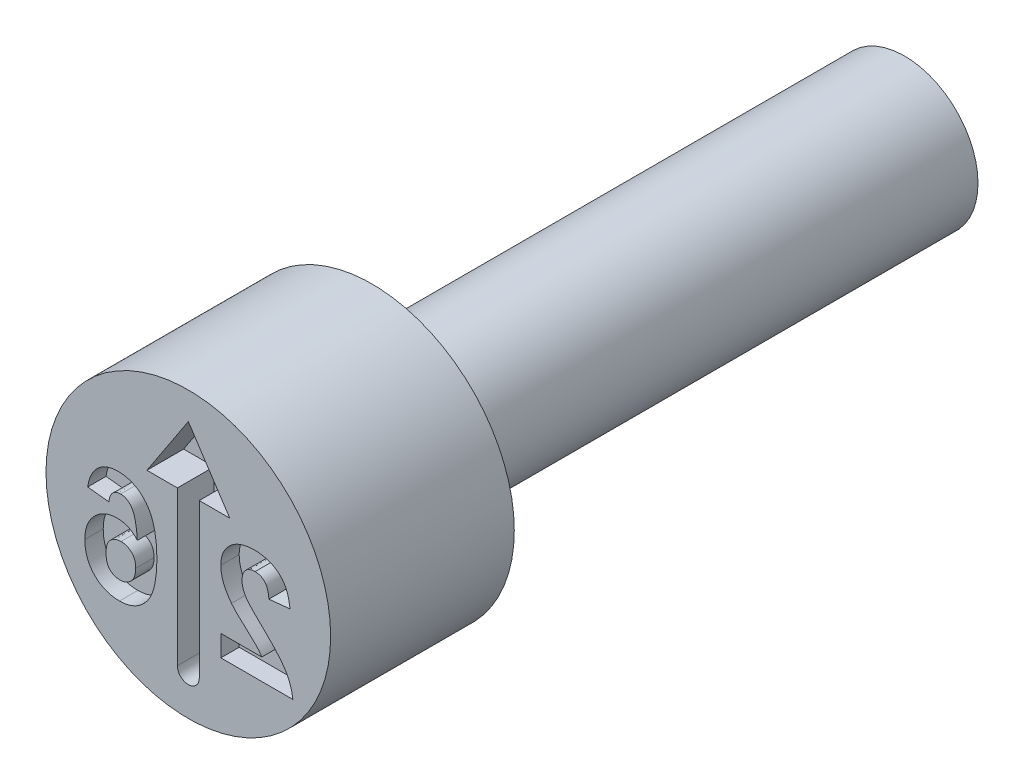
ISO-10303-21;
HEADER;
FILE_DESCRIPTION(('STEP AP214'),'2;1');
FILE_NAME('part.step','',(''),(''),'','','');
FILE_SCHEMA(('AUTOMOTIVE_DESIGN { 1 0 10303 214 1 1 1 1 }'));
ENDSEC;
DATA;
#1=APPLICATION_CONTEXT('core data for automotive mechanical design processes');
#2=APPLICATION_PROTOCOL_DEFINITION('international standard','automotive_design',2000,#1);
#3=PRODUCT_CONTEXT('',#1,'mechanical');
#4=PRODUCT('Part','Part','',(#3));
#5=PRODUCT_RELATED_PRODUCT_CATEGORY('part','',(#4));
#6=PRODUCT_DEFINITION_FORMATION('','',#4);
#7=PRODUCT_DEFINITION_CONTEXT('part definition',#1,'design');
#8=PRODUCT_DEFINITION('design','',#6,#7);
#9=PRODUCT_DEFINITION_SHAPE('','',#8);
#10=(LENGTH_UNIT() NAMED_UNIT(*) SI_UNIT(.MILLI.,.METRE.));
#11=(NAMED_UNIT(*) PLANE_ANGLE_UNIT() SI_UNIT($,.RADIAN.));
#12=(NAMED_UNIT(*) SI_UNIT($,.STERADIAN.) SOLID_ANGLE_UNIT());
#13=UNCERTAINTY_MEASURE_WITH_UNIT(LENGTH_MEASURE(1.E-05),#10,'distance_accuracy_value','');
#14=(GEOMETRIC_REPRESENTATION_CONTEXT(3) GLOBAL_UNCERTAINTY_ASSIGNED_CONTEXT((#13)) GLOBAL_UNIT_ASSIGNED_CONTEXT((#10,
#11,#12)) REPRESENTATION_CONTEXT('',''));
#15=CARTESIAN_POINT('',(0.,0.,0.));
#16=DIRECTION('',(0.,0.,1.));
#17=DIRECTION('',(1.,0.,0.));
#18=AXIS2_PLACEMENT_3D('',#15,#16,#17);
#19=CARTESIAN_POINT('',(0.,1.55,0.));
#20=DIRECTION('',(0.,0.,-1.));
#21=DIRECTION('',(-1.,0.,0.));
#22=AXIS2_PLACEMENT_3D('',#19,#20,#21);
#23=PLANE('',#22);
#24=DIRECTION('',(0.994071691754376,-0.108726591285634,0.));
#25=VECTOR('',#24,1.);
#26=CARTESIAN_POINT('',(-1.096,0.086778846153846,0.));
#27=LINE('',#26,#25);
#28=CARTESIAN_POINT('',(-1.096,0.0867788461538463,0.));
#29=VERTEX_POINT('',#28);
#30=CARTESIAN_POINT('',(-0.865230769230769,0.0615384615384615,0.));
#31=VERTEX_POINT('',#30);
#32=EDGE_CURVE('E334',#29,#31,#27,.T.);
#33=ORIENTED_EDGE('',*,*,#32,.F.);
#34=CARTESIAN_POINT('',(-0.766673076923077,0.4,0.));
#35=CARTESIAN_POINT('',(-0.777503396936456,0.399805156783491,0.));
#36=CARTESIAN_POINT('',(-0.798675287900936,0.399424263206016,0.));
#37=CARTESIAN_POINT('',(-0.829705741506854,0.395379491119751,0.));
#38=CARTESIAN_POINT('',(-0.859308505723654,0.389194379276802,0.));
#39=CARTESIAN_POINT('',(-0.887561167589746,0.380632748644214,0.));
#40=CARTESIAN_POINT('',(-0.914264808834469,0.369167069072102,0.));
#41=CARTESIAN_POINT('',(-0.939525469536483,0.355199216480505,0.));
#42=CARTESIAN_POINT('',(-0.963428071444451,0.338767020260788,0.));
#43=CARTESIAN_POINT('',(-0.985848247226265,0.319976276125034,0.));
#44=CARTESIAN_POINT('',(-1.00660555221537,0.298770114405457,0.));
#45=CARTESIAN_POINT('',(-1.02534891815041,0.275100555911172,0.));
#46=CARTESIAN_POINT('',(-1.04220247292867,0.249253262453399,0.));
#47=CARTESIAN_POINT('',(-1.05723997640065,0.221249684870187,0.));
#48=CARTESIAN_POINT('',(-1.06985318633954,0.190821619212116,0.));
#49=CARTESIAN_POINT('',(-1.08069632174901,0.158208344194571,0.));
#50=CARTESIAN_POINT('',(-1.08961404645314,0.123339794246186,0.));
#51=CARTESIAN_POINT('',(-1.09383889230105,0.0991516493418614,0.));
#52=CARTESIAN_POINT('',(-1.096,0.086778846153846,0.));
#53=B_SPLINE_CURVE_WITH_KNOTS('',3,(#34,#35,#36,#37,#38,#39,#40,#41,#42,#43,#44,#45,#46,#47,#48,
#49,#50,#51,#52),.UNSPECIFIED.,.F.,.F.,(4,1,1,1,1,1,1,1,1,1,1,1,1,1,1,1,4),(0.,
0.0647517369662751,0.126581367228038,0.186839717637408,0.245514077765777,0.302849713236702,
0.360345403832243,0.417912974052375,0.476091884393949,0.535068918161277,0.59510381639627,
0.656390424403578,0.719434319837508,0.784953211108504,0.853160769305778,0.924888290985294,1.),.UNSPECIFIED.);
#54=CARTESIAN_POINT('',(-0.766673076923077,0.4,0.));
#55=VERTEX_POINT('',#54);
#56=EDGE_CURVE('E54',#55,#29,#53,.T.);
#57=ORIENTED_EDGE('',*,*,#56,.F.);
#58=CARTESIAN_POINT('',(-0.342153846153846,-0.216105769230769,0.));
#59=CARTESIAN_POINT('',(-0.342512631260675,-0.1898130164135,0.));
#60=CARTESIAN_POINT('',(-0.343205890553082,-0.139009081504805,0.));
#61=CARTESIAN_POINT('',(-0.348784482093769,-0.0656551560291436,0.));
#62=CARTESIAN_POINT('',(-0.357645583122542,0.0020840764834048,0.));
#63=CARTESIAN_POINT('',(-0.370553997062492,0.0640558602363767,0.));
#64=CARTESIAN_POINT('',(-0.38706485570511,0.120388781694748,0.));
#65=CARTESIAN_POINT('',(-0.407081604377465,0.171196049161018,0.));
#66=CARTESIAN_POINT('',(-0.431107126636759,0.216293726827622,0.));
#67=CARTESIAN_POINT('',(-0.459040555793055,0.255535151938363,0.));
#68=CARTESIAN_POINT('',(-0.489775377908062,0.289646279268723,0.));
#69=CARTESIAN_POINT('',(-0.522800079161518,0.319089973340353,0.));
#70=CARTESIAN_POINT('',(-0.557988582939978,0.344150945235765,0.));
#71=CARTESIAN_POINT('',(-0.59534004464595,0.364765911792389,0.));
#72=CARTESIAN_POINT('',(-0.635161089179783,0.380394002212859,0.));
#73=CARTESIAN_POINT('',(-0.677074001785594,0.391679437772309,0.));
#74=CARTESIAN_POINT('',(-0.72114918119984,0.398932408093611,0.));
#75=CARTESIAN_POINT('',(-0.751339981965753,0.399640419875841,0.));
#76=CARTESIAN_POINT('',(-0.766673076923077,0.4,0.));
#77=B_SPLINE_CURVE_WITH_KNOTS('',3,(#58,#59,#60,#61,#62,#63,#64,#65,#66,#67,#68,#69,#70,#71,#72,
#73,#74,#75,#76),.UNSPECIFIED.,.F.,.F.,(4,1,1,1,1,1,1,1,1,1,1,1,1,1,1,1,4),(0.,
0.0932311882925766,0.180145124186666,0.260720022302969,0.335343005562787,0.40439372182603,
0.46866345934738,0.528671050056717,0.585123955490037,0.639046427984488,0.691174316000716,
0.741714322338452,0.79194664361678,0.84207517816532,0.893016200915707,0.945665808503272,1.),.UNSPECIFIED.);
#78=CARTESIAN_POINT('',(-0.342153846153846,-0.216105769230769,0.));
#79=VERTEX_POINT('',#78);
#80=EDGE_CURVE('E385',#79,#55,#77,.T.);
#81=ORIENTED_EDGE('',*,*,#80,.F.);
#82=CARTESIAN_POINT('',(-0.749365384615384,-0.815384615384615,0.));
#83=CARTESIAN_POINT('',(-0.73483862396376,-0.814978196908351,0.));
#84=CARTESIAN_POINT('',(-0.706276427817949,-0.814179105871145,0.));
#85=CARTESIAN_POINT('',(-0.664464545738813,-0.807602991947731,0.));
#86=CARTESIAN_POINT('',(-0.624713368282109,-0.796477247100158,0.));
#87=CARTESIAN_POINT('',(-0.58702783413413,-0.780939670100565,0.));
#88=CARTESIAN_POINT('',(-0.551094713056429,-0.761395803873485,0.));
#89=CARTESIAN_POINT('',(-0.517247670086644,-0.737118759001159,0.));
#90=CARTESIAN_POINT('',(-0.485576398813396,-0.708340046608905,0.));
#91=CARTESIAN_POINT('',(-0.455661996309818,-0.675449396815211,0.));
#92=CARTESIAN_POINT('',(-0.42844069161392,-0.63745809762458,0.));
#93=CARTESIAN_POINT('',(-0.405258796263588,-0.593548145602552,0.));
#94=CARTESIAN_POINT('',(-0.385598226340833,-0.544200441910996,0.));
#95=CARTESIAN_POINT('',(-0.369591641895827,-0.489288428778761,0.));
#96=CARTESIAN_POINT('',(-0.357235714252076,-0.428816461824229,0.));
#97=CARTESIAN_POINT('',(-0.348614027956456,-0.362779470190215,0.));
#98=CARTESIAN_POINT('',(-0.342887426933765,-0.291286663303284,0.));
#99=CARTESIAN_POINT('',(-0.342404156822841,-0.241758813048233,0.));
#100=CARTESIAN_POINT('',(-0.342153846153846,-0.216105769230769,0.));
#101=B_SPLINE_CURVE_WITH_KNOTS('',3,(#82,#83,#84,#85,#86,#87,#88,#89,#90,#91,#92,#93,#94,#95,
#96,#97,#98,#99,#100),.UNSPECIFIED.,.F.,.F.,(4,1,1,1,1,1,1,1,1,1,1,1,1,1,1,1,4),(0.,
0.0532594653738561,0.104717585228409,0.154775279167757,0.20433007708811,0.25391362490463,
0.304476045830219,0.356706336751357,0.410596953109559,0.467274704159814,0.52762561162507,
0.59224090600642,0.661798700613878,0.737130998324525,0.818387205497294,0.905933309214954,1.),.UNSPECIFIED.);
#102=CARTESIAN_POINT('',(-0.749365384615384,-0.815384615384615,0.));
#103=VERTEX_POINT('',#102);
#104=EDGE_CURVE('E377',#103,#79,#101,.T.);
#105=ORIENTED_EDGE('',*,*,#104,.F.);
#106=CARTESIAN_POINT('',(-1.12676923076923,-0.424038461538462,0.));
#107=CARTESIAN_POINT('',(-1.12643613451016,-0.438473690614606,0.));
#108=CARTESIAN_POINT('',(-1.12578651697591,-0.46662584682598,0.));
#109=CARTESIAN_POINT('',(-1.12100487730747,-0.507855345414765,0.));
#110=CARTESIAN_POINT('',(-1.11255847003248,-0.546771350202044,0.));
#111=CARTESIAN_POINT('',(-1.10101885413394,-0.583686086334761,0.));
#112=CARTESIAN_POINT('',(-1.08609269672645,-0.618307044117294,0.));
#113=CARTESIAN_POINT('',(-1.06801086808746,-0.650919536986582,0.));
#114=CARTESIAN_POINT('',(-1.04616146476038,-0.680966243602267,0.));
#115=CARTESIAN_POINT('',(-1.02153606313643,-0.70885133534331,0.));
#116=CARTESIAN_POINT('',(-0.994083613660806,-0.733735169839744,0.));
#117=CARTESIAN_POINT('',(-0.964827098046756,-0.755770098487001,0.));
#118=CARTESIAN_POINT('',(-0.933442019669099,-0.774087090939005,0.));
#119=CARTESIAN_POINT('',(-0.900392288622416,-0.789503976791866,0.));
#120=CARTESIAN_POINT('',(-0.865110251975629,-0.800817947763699,0.));
#121=CARTESIAN_POINT('',(-0.828217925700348,-0.809302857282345,0.));
#122=CARTESIAN_POINT('',(-0.78941532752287,-0.814477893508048,0.));
#123=CARTESIAN_POINT('',(-0.762923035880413,-0.815077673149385,0.));
#124=CARTESIAN_POINT('',(-0.749365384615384,-0.815384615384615,0.));
#125=B_SPLINE_CURVE_WITH_KNOTS('',3,(#106,#107,#108,#109,#110,#111,#112,#113,#114,#115,#116,
#117,#118,#119,#120,#121,#122,#123,#124),.UNSPECIFIED.,.F.,.F.,(4,1,1,1,1,1,1,1,1,1,1,1,1,1,1,1,
4),(0.,0.0708046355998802,0.13808600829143,0.203231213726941,0.265884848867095,
0.327509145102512,0.387868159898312,0.448411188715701,0.509386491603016,0.570040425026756,
0.629864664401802,0.68871511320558,0.747985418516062,0.80839432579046,0.870086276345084,
0.933515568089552,1.),.UNSPECIFIED.);
#126=CARTESIAN_POINT('',(-1.12676923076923,-0.424038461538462,0.));
#127=VERTEX_POINT('',#126);
#128=EDGE_CURVE('E369',#127,#103,#125,.T.);
#129=ORIENTED_EDGE('',*,*,#128,.F.);
#130=CARTESIAN_POINT('',(-0.772201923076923,-0.0461538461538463,0.));
#131=CARTESIAN_POINT('',(-0.784154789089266,-0.0464980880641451,0.));
#132=CARTESIAN_POINT('',(-0.807757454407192,-0.0471778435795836,0.));
#133=CARTESIAN_POINT('',(-0.842529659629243,-0.0519455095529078,0.));
#134=CARTESIAN_POINT('',(-0.875895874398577,-0.0605186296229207,0.));
#135=CARTESIAN_POINT('',(-0.90800704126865,-0.0721158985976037,0.));
#136=CARTESIAN_POINT('',(-0.939021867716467,-0.0867197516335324,0.));
#137=CARTESIAN_POINT('',(-0.968347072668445,-0.105206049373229,0.));
#138=CARTESIAN_POINT('',(-0.996442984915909,-0.126760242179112,0.));
#139=CARTESIAN_POINT('',(-1.02292320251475,-0.15138564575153,0.));
#140=CARTESIAN_POINT('',(-1.04725215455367,-0.178496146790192,0.));
#141=CARTESIAN_POINT('',(-1.06873221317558,-0.20777763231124,0.));
#142=CARTESIAN_POINT('',(-1.08640959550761,-0.23931952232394,0.));
#143=CARTESIAN_POINT('',(-1.10152163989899,-0.272415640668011,0.));
#144=CARTESIAN_POINT('',(-1.112765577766,-0.307719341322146,0.));
#145=CARTESIAN_POINT('',(-1.12092748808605,-0.344722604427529,0.));
#146=CARTESIAN_POINT('',(-1.12579957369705,-0.383765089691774,0.));
#147=CARTESIAN_POINT('',(-1.12644092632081,-0.410402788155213,0.));
#148=CARTESIAN_POINT('',(-1.12676923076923,-0.424038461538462,0.));
#149=B_SPLINE_CURVE_WITH_KNOTS('',3,(#130,#131,#132,#133,#134,#135,#136,#137,#138,#139,#140,
#141,#142,#143,#144,#145,#146,#147,#148),.UNSPECIFIED.,.F.,.F.,(4,1,1,1,1,1,1,1,1,1,1,1,1,1,1,1,
4),(0.,0.0619593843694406,0.122347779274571,0.181484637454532,0.240217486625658,
0.299114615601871,0.358819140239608,0.419550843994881,0.482449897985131,0.545990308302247,
0.608137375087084,0.670271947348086,0.733113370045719,0.796428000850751,0.8619364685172,
0.9293261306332,1.),.UNSPECIFIED.);
#150=CARTESIAN_POINT('',(-0.772201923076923,-0.0461538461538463,0.));
#151=VERTEX_POINT('',#150);
#152=EDGE_CURVE('E361',#151,#127,#149,.T.);
#153=ORIENTED_EDGE('',*,*,#152,.F.);
#154=CARTESIAN_POINT('',(-0.555375,-0.146634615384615,0.));
#155=CARTESIAN_POINT('',(-0.562750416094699,-0.138623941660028,0.));
#156=CARTESIAN_POINT('',(-0.577212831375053,-0.12291585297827,0.));
#157=CARTESIAN_POINT('',(-0.601210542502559,-0.102436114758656,0.));
#158=CARTESIAN_POINT('',(-0.626351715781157,-0.084927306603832,0.));
#159=CARTESIAN_POINT('',(-0.652909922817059,-0.0705628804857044,0.));
#160=CARTESIAN_POINT('',(-0.68103012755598,-0.0598732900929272,0.));
#161=CARTESIAN_POINT('',(-0.710202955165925,-0.0517568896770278,0.));
#162=CARTESIAN_POINT('',(-0.740810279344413,-0.0472104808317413,0.));
#163=CARTESIAN_POINT('',(-0.761610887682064,-0.0465103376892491,0.));
#164=CARTESIAN_POINT('',(-0.772201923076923,-0.0461538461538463,0.));
#165=B_SPLINE_CURVE_WITH_KNOTS('',3,(#154,#155,#156,#157,#158,#159,#160,#161,#162,#163,#164),
.UNSPECIFIED.,.F.,.F.,(4,1,1,1,1,1,1,1,4),(0.,0.132218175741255,0.259265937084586,
0.382426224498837,0.503963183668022,0.625109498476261,0.747226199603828,0.871295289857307,1.),.UNSPECIFIED.);
#166=CARTESIAN_POINT('',(-0.555374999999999,-0.146634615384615,0.));
#167=VERTEX_POINT('',#166);
#168=EDGE_CURVE('E353',#167,#151,#165,.T.);
#169=ORIENTED_EDGE('',*,*,#168,.F.);
#170=CARTESIAN_POINT('',(-0.737105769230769,0.2,0.));
#171=CARTESIAN_POINT('',(-0.731318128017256,0.199858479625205,0.));
#172=CARTESIAN_POINT('',(-0.719801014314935,0.199576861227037,0.));
#173=CARTESIAN_POINT('',(-0.703024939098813,0.196001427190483,0.));
#174=CARTESIAN_POINT('',(-0.686850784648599,0.190695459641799,0.));
#175=CARTESIAN_POINT('',(-0.67141055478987,0.183180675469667,0.));
#176=CARTESIAN_POINT('',(-0.656627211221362,0.173484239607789,0.));
#177=CARTESIAN_POINT('',(-0.642725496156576,0.161490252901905,0.));
#178=CARTESIAN_POINT('',(-0.629066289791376,0.147830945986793,0.));
#179=CARTESIAN_POINT('',(-0.616453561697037,0.131336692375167,0.));
#180=CARTESIAN_POINT('',(-0.604353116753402,0.111806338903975,0.));
#181=CARTESIAN_POINT('',(-0.593934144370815,0.0878975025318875,0.));
#182=CARTESIAN_POINT('',(-0.584647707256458,0.0596323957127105,0.));
#183=CARTESIAN_POINT('',(-0.576696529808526,0.0268725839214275,0.));
#184=CARTESIAN_POINT('',(-0.56948091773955,-0.0101739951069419,0.));
#185=CARTESIAN_POINT('',(-0.563566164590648,-0.0516573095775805,0.));
#186=CARTESIAN_POINT('',(-0.558833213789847,-0.0976146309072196,0.));
#187=CARTESIAN_POINT('',(-0.556562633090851,-0.129799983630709,0.));
#188=CARTESIAN_POINT('',(-0.555374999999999,-0.146634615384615,0.));
#189=B_SPLINE_CURVE_WITH_KNOTS('',3,(#170,#171,#172,#173,#174,#175,#176,#177,#178,#179,#180,
#181,#182,#183,#184,#185,#186,#187,#188),.UNSPECIFIED.,.F.,.F.,(4,1,1,1,1,1,1,1,1,1,1,1,1,1,1,1,
4),(0.,0.0401536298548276,0.0799036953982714,0.118642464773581,0.158240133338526,
0.198858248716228,0.241137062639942,0.285631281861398,0.332856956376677,0.385095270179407,
0.444912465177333,0.513585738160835,0.591645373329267,0.679009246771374,0.775790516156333,
0.882726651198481,1.),.UNSPECIFIED.);
#190=CARTESIAN_POINT('',(-0.737105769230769,0.2,0.));
#191=VERTEX_POINT('',#190);
#192=EDGE_CURVE('E345',#191,#167,#189,.T.);
#193=ORIENTED_EDGE('',*,*,#192,.F.);
#194=CARTESIAN_POINT('',(-0.865230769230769,0.0615384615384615,0.));
#195=CARTESIAN_POINT('',(-0.863684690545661,0.0726533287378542,0.));
#196=CARTESIAN_POINT('',(-0.860775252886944,0.0935694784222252,0.));
#197=CARTESIAN_POINT('',(-0.852157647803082,0.122433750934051,0.));
#198=CARTESIAN_POINT('',(-0.840160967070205,0.146715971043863,0.));
#199=CARTESIAN_POINT('',(-0.824762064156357,0.16645009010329,0.));
#200=CARTESIAN_POINT('',(-0.806420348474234,0.181638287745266,0.));
#201=CARTESIAN_POINT('',(-0.78552095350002,0.192430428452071,0.));
#202=CARTESIAN_POINT('',(-0.762077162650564,0.198836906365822,0.));
#203=CARTESIAN_POINT('',(-0.745640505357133,0.199602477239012,0.));
#204=CARTESIAN_POINT('',(-0.737105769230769,0.2,0.));
#205=B_SPLINE_CURVE_WITH_KNOTS('',3,(#194,#195,#196,#197,#198,#199,#200,#201,#202,#203,#204),
.UNSPECIFIED.,.F.,.F.,(4,1,1,1,1,1,1,1,4),(0.,0.160089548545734,0.301259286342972,
0.428171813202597,0.544692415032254,0.656041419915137,0.765564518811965,0.878269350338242,1.),.UNSPECIFIED.);
#206=EDGE_CURVE('E340',#31,#191,#205,.T.);
#207=ORIENTED_EDGE('',*,*,#206,.F.);
#208=EDGE_LOOP('',(#33,#57,#81,#105,#129,#153,#169,#193,#207));
#209=FACE_BOUND('',#208,.T.);
#210=CARTESIAN_POINT('',(0.,0.,0.));
#211=DIRECTION('',(0.,0.,1.));
#212=DIRECTION('',(1.,0.,0.));
#213=AXIS2_PLACEMENT_3D('',#210,#211,#212);
#214=CIRCLE('',#213,1.55);
#215=CARTESIAN_POINT('',(1.55,0.,0.));
#216=VERTEX_POINT('',#215);
#217=EDGE_CURVE('E47',#216,#216,#214,.T.);
#218=ORIENTED_EDGE('',*,*,#217,.T.);
#219=EDGE_LOOP('',(#218));
#220=FACE_BOUND('',#219,.T.);
#221=DIRECTION('',(0.,1.,0.));
#222=VECTOR('',#221,1.);
#223=CARTESIAN_POINT('',(0.119045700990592,0.566469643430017,0.));
#224=LINE('',#223,#222);
#225=CARTESIAN_POINT('',(0.119045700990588,-1.11010114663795,0.));
#226=VERTEX_POINT('',#225);
#227=CARTESIAN_POINT('',(0.119045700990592,0.566469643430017,0.));
#228=VERTEX_POINT('',#227);
#229=EDGE_CURVE('E527',#226,#228,#224,.T.);
#230=ORIENTED_EDGE('',*,*,#229,.F.);
#231=CARTESIAN_POINT('',(1.02140308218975E-13,-1.11010114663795,0.));
#232=DIRECTION('',(0.,0.,1.));
#233=DIRECTION('',(1.,0.,0.));
#234=AXIS2_PLACEMENT_3D('',#231,#232,#233);
#235=CIRCLE('',#234,0.119045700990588);
#236=CARTESIAN_POINT('',(-0.119045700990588,-1.11010114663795,0.));
#237=VERTEX_POINT('',#236);
#238=EDGE_CURVE('E619',#237,#226,#235,.T.);
#239=ORIENTED_EDGE('',*,*,#238,.F.);
#240=DIRECTION('',(0.,-1.,0.));
#241=VECTOR('',#240,1.);
#242=CARTESIAN_POINT('',(-0.119045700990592,0.566469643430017,0.));
#243=LINE('',#242,#241);
#244=CARTESIAN_POINT('',(-0.119045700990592,0.566469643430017,0.));
#245=VERTEX_POINT('',#244);
#246=EDGE_CURVE('E649',#245,#237,#243,.T.);
#247=ORIENTED_EDGE('',*,*,#246,.F.);
#248=DIRECTION('',(1.,0.,0.));
#249=VECTOR('',#248,1.);
#250=CARTESIAN_POINT('',(-0.451198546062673,0.566469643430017,0.));
#251=LINE('',#250,#249);
#252=CARTESIAN_POINT('',(-0.451198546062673,0.566469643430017,0.));
#253=VERTEX_POINT('',#252);
#254=EDGE_CURVE('E679',#253,#245,#251,.T.);
#255=ORIENTED_EDGE('',*,*,#254,.F.);
#256=DIRECTION('',(-0.550159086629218,-0.835059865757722,0.));
#257=VECTOR('',#256,1.);
#258=CARTESIAN_POINT('',(0.,1.25132209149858,0.));
#259=LINE('',#258,#257);
#260=CARTESIAN_POINT('',(0.,1.25132209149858,0.));
#261=VERTEX_POINT('',#260);
#262=EDGE_CURVE('E676',#261,#253,#259,.T.);
#263=ORIENTED_EDGE('',*,*,#262,.F.);
#264=DIRECTION('',(-0.550159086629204,0.835059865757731,0.));
#265=VECTOR('',#264,1.);
#266=CARTESIAN_POINT('',(0.,1.25132209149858,0.));
#267=LINE('',#266,#265);
#268=CARTESIAN_POINT('',(0.451198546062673,0.566469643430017,0.));
#269=VERTEX_POINT('',#268);
#270=EDGE_CURVE('E673',#269,#261,#267,.T.);
#271=ORIENTED_EDGE('',*,*,#270,.F.);
#272=DIRECTION('',(1.,0.,0.));
#273=VECTOR('',#272,1.);
#274=CARTESIAN_POINT('',(0.451198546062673,0.566469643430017,0.));
#275=LINE('',#274,#273);
#276=EDGE_CURVE('E670',#228,#269,#275,.T.);
#277=ORIENTED_EDGE('',*,*,#276,.F.);
#278=EDGE_LOOP('',(#230,#239,#247,#255,#263,#271,#277));
#279=FACE_BOUND('',#278,.T.);
#280=DIRECTION('',(0.,-1.,0.));
#281=VECTOR('',#280,1.);
#282=CARTESIAN_POINT('',(0.353846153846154,-0.569230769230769,0.));
#283=LINE('',#282,#281);
#284=CARTESIAN_POINT('',(0.353846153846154,-0.569230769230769,0.));
#285=VERTEX_POINT('',#284);
#286=CARTESIAN_POINT('',(0.353846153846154,-0.8,0.));
#287=VERTEX_POINT('',#286);
#288=EDGE_CURVE('E532',#285,#287,#283,.T.);
#289=ORIENTED_EDGE('',*,*,#288,.F.);
#290=DIRECTION('',(-1.,0.,0.));
#291=VECTOR('',#290,1.);
#292=CARTESIAN_POINT('',(0.799759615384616,-0.569230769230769,0.));
#293=LINE('',#292,#291);
#294=CARTESIAN_POINT('',(0.799759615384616,-0.569230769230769,0.));
#295=VERTEX_POINT('',#294);
#296=EDGE_CURVE('E399',#295,#285,#293,.T.);
#297=ORIENTED_EDGE('',*,*,#296,.F.);
#298=CARTESIAN_POINT('',(0.470192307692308,-0.227403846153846,0.));
#299=CARTESIAN_POINT('',(0.473842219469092,-0.232000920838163,0.));
#300=CARTESIAN_POINT('',(0.48165948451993,-0.241846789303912,0.));
#301=CARTESIAN_POINT('',(0.494958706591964,-0.256943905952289,0.));
#302=CARTESIAN_POINT('',(0.510371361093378,-0.273434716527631,0.));
#303=CARTESIAN_POINT('',(0.527679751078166,-0.291627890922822,0.));
#304=CARTESIAN_POINT('',(0.547455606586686,-0.310879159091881,0.));
#305=CARTESIAN_POINT('',(0.568987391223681,-0.331993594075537,0.));
#306=CARTESIAN_POINT('',(0.593222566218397,-0.35389112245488,0.));
#307=CARTESIAN_POINT('',(0.618324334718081,-0.377117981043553,0.));
#308=CARTESIAN_POINT('',(0.64353521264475,-0.399724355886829,0.));
#309=CARTESIAN_POINT('',(0.666707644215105,-0.421195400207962,0.));
#310=CARTESIAN_POINT('',(0.687755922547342,-0.44019266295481,0.));
#311=CARTESIAN_POINT('',(0.705699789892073,-0.457764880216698,0.));
#312=CARTESIAN_POINT('',(0.721594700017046,-0.472712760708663,0.));
#313=CARTESIAN_POINT('',(0.734867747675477,-0.485802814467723,0.));
#314=CARTESIAN_POINT('',(0.745767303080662,-0.496718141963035,0.));
#315=CARTESIAN_POINT('',(0.760786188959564,-0.513732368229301,0.));
#316=CARTESIAN_POINT('',(0.779896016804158,-0.536744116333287,0.));
#317=CARTESIAN_POINT('',(0.793340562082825,-0.558732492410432,0.));
#318=CARTESIAN_POINT('',(0.799759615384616,-0.569230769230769,0.));
#319=B_SPLINE_CURVE_WITH_KNOTS('',3,(#298,#299,#300,#301,#302,#303,#304,#305,#306,#307,#308,
#309,#310,#311,#312,#313,#314,#315,#316,#317,#318),.UNSPECIFIED.,.F.,.F.,(4,1,1,1,1,1,1,1,1,1,1,
1,1,1,1,1,1,1,4),(0.,0.0369753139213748,0.0791925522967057,0.126700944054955,0.179184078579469,
0.237368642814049,0.300558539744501,0.369153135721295,0.443112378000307,0.516018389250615,
0.582473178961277,0.642136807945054,0.694619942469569,0.740679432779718,0.779589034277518,
0.812073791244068,0.837814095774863,0.922564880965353,1.),.UNSPECIFIED.);
#320=CARTESIAN_POINT('',(0.470192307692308,-0.227403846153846,0.));
#321=VERTEX_POINT('',#320);
#322=EDGE_CURVE('E419',#321,#295,#319,.T.);
#323=ORIENTED_EDGE('',*,*,#322,.F.);
#324=CARTESIAN_POINT('',(0.353846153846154,0.0735576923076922,0.));
#325=CARTESIAN_POINT('',(0.354139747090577,0.0604771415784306,0.));
#326=CARTESIAN_POINT('',(0.354722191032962,0.0345273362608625,0.));
#327=CARTESIAN_POINT('',(0.360298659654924,-0.00383422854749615,0.));
#328=CARTESIAN_POINT('',(0.368818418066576,-0.0413111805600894,0.));
#329=CARTESIAN_POINT('',(0.381409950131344,-0.0779951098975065,0.));
#330=CARTESIAN_POINT('',(0.397370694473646,-0.114765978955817,0.));
#331=CARTESIAN_POINT('',(0.417944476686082,-0.151706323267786,0.));
#332=CARTESIAN_POINT('',(0.441832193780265,-0.189930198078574,0.));
#333=CARTESIAN_POINT('',(0.46053533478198,-0.21464360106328,0.));
#334=CARTESIAN_POINT('',(0.470192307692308,-0.227403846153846,0.));
#335=B_SPLINE_CURVE_WITH_KNOTS('',3,(#324,#325,#326,#327,#328,#329,#330,#331,#332,#333,#334),
.UNSPECIFIED.,.F.,.F.,(4,1,1,1,1,1,1,1,4),(0.,0.119176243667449,0.236427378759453,
0.352663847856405,0.469086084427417,0.589462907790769,0.717601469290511,0.854189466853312,1.),.UNSPECIFIED.);
#336=CARTESIAN_POINT('',(0.353846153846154,0.0735576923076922,0.));
#337=VERTEX_POINT('',#336);
#338=EDGE_CURVE('E599',#337,#321,#335,.T.);
#339=ORIENTED_EDGE('',*,*,#338,.F.);
#340=CARTESIAN_POINT('',(0.722115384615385,0.4,0.));
#341=CARTESIAN_POINT('',(0.708162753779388,0.399731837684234,0.));
#342=CARTESIAN_POINT('',(0.680988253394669,0.399209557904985,0.));
#343=CARTESIAN_POINT('',(0.641318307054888,0.394896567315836,0.));
#344=CARTESIAN_POINT('',(0.604051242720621,0.387376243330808,0.));
#345=CARTESIAN_POINT('',(0.568861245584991,0.377414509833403,0.));
#346=CARTESIAN_POINT('',(0.536109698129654,0.364114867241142,0.));
#347=CARTESIAN_POINT('',(0.505523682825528,0.348036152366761,0.));
#348=CARTESIAN_POINT('',(0.477584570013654,0.32856814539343,0.));
#349=CARTESIAN_POINT('',(0.451875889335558,0.306772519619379,0.));
#350=CARTESIAN_POINT('',(0.428894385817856,0.282804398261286,0.));
#351=CARTESIAN_POINT('',(0.408764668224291,0.257238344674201,0.));
#352=CARTESIAN_POINT('',(0.391900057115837,0.230092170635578,0.));
#353=CARTESIAN_POINT('',(0.37774805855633,0.201696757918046,0.));
#354=CARTESIAN_POINT('',(0.367240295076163,0.171595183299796,0.));
#355=CARTESIAN_POINT('',(0.35958388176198,0.140203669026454,0.));
#356=CARTESIAN_POINT('',(0.354507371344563,0.10737576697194,0.));
#357=CARTESIAN_POINT('',(0.354068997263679,0.0849550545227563,0.));
#358=CARTESIAN_POINT('',(0.353846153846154,0.0735576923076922,0.));
#359=B_SPLINE_CURVE_WITH_KNOTS('',3,(#340,#341,#342,#343,#344,#345,#346,#347,#348,#349,#350,
#351,#352,#353,#354,#355,#356,#357,#358),.UNSPECIFIED.,.F.,.F.,(4,1,1,1,1,1,1,1,1,1,1,1,1,1,1,1,
4),(0.,0.0756723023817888,0.147381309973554,0.216084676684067,0.28169803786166,
0.345459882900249,0.407485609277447,0.46873129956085,0.529782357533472,0.590032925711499,
0.648548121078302,0.70595351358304,0.763101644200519,0.820289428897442,0.878479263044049,
0.938226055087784,1.),.UNSPECIFIED.);
#360=CARTESIAN_POINT('',(0.722115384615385,0.4,0.));
#361=VERTEX_POINT('',#360);
#362=EDGE_CURVE('E591',#361,#337,#359,.T.);
#363=ORIENTED_EDGE('',*,*,#362,.F.);
#364=CARTESIAN_POINT('',(1.10769230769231,0.0379807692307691,0.));
#365=CARTESIAN_POINT('',(1.10583695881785,0.0535606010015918,0.));
#366=CARTESIAN_POINT('',(1.10223973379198,0.0837674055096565,0.));
#367=CARTESIAN_POINT('',(1.09326279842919,0.127154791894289,0.));
#368=CARTESIAN_POINT('',(1.08189384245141,0.167181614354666,0.));
#369=CARTESIAN_POINT('',(1.06759086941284,0.203773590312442,0.));
#370=CARTESIAN_POINT('',(1.05094503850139,0.23716340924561,0.));
#371=CARTESIAN_POINT('',(1.03110727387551,0.266850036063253,0.));
#372=CARTESIAN_POINT('',(1.00877072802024,0.293162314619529,0.));
#373=CARTESIAN_POINT('',(0.983916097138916,0.316086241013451,0.));
#374=CARTESIAN_POINT('',(0.956701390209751,0.335694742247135,0.));
#375=CARTESIAN_POINT('',(0.928144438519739,0.353198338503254,0.));
#376=CARTESIAN_POINT('',(0.897687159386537,0.36755685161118,0.));
#377=CARTESIAN_POINT('',(0.865664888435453,0.379390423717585,0.));
#378=CARTESIAN_POINT('',(0.832092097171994,0.388847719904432,0.));
#379=CARTESIAN_POINT('',(0.796813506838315,0.395100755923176,0.));
#380=CARTESIAN_POINT('',(0.760046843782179,0.399499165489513,0.));
#381=CARTESIAN_POINT('',(0.734949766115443,0.399830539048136,0.));
#382=CARTESIAN_POINT('',(0.722115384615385,0.4,0.));
#383=B_SPLINE_CURVE_WITH_KNOTS('',3,(#364,#365,#366,#367,#368,#369,#370,#371,#372,#373,#374,
#375,#376,#377,#378,#379,#380,#381,#382),.UNSPECIFIED.,.F.,.F.,(4,1,1,1,1,1,1,1,1,1,1,1,1,1,1,1,
4),(0.,0.0794357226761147,0.154013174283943,0.224141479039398,0.289934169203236,
0.352732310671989,0.412725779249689,0.470302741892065,0.527168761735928,0.583502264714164,
0.639948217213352,0.696584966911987,0.753726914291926,0.812707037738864,0.872963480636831,
0.93503486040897,1.),.UNSPECIFIED.);
#384=CARTESIAN_POINT('',(1.10769230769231,0.0379807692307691,0.));
#385=VERTEX_POINT('',#384);
#386=EDGE_CURVE('E586',#385,#361,#383,.T.);
#387=ORIENTED_EDGE('',*,*,#386,.F.);
#388=DIRECTION('',(0.995240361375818,0.0974506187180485,0.));
#389=VECTOR('',#388,1.);
#390=CARTESIAN_POINT('',(0.876923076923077,0.0153846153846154,0.));
#391=LINE('',#390,#389);
#392=CARTESIAN_POINT('',(0.876923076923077,0.0153846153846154,0.));
#393=VERTEX_POINT('',#392);
#394=EDGE_CURVE('E580',#393,#385,#391,.T.);
#395=ORIENTED_EDGE('',*,*,#394,.F.);
#396=CARTESIAN_POINT('',(0.726923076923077,0.2,0.));
#397=CARTESIAN_POINT('',(0.737389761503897,0.199525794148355,0.));
#398=CARTESIAN_POINT('',(0.757609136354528,0.198609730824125,0.));
#399=CARTESIAN_POINT('',(0.786345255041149,0.190607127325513,0.));
#400=CARTESIAN_POINT('',(0.811484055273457,0.176753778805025,0.));
#401=CARTESIAN_POINT('',(0.829399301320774,0.160966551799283,0.));
#402=CARTESIAN_POINT('',(0.841501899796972,0.145614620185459,0.));
#403=CARTESIAN_POINT('',(0.849748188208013,0.132236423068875,0.));
#404=CARTESIAN_POINT('',(0.856855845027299,0.117034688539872,0.));
#405=CARTESIAN_POINT('',(0.863153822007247,0.100180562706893,0.));
#406=CARTESIAN_POINT('',(0.868128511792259,0.0814809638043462,0.));
#407=CARTESIAN_POINT('',(0.872134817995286,0.0610783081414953,0.));
#408=CARTESIAN_POINT('',(0.875363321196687,0.038862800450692,0.));
#409=CARTESIAN_POINT('',(0.876390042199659,0.023408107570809,0.));
#410=CARTESIAN_POINT('',(0.876923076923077,0.0153846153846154,0.));
#411=B_SPLINE_CURVE_WITH_KNOTS('',3,(#396,#397,#398,#399,#400,#401,#402,#403,#404,#405,#406,
#407,#408,#409,#410),.UNSPECIFIED.,.F.,.F.,(4,1,1,1,1,1,1,1,1,1,1,1,4),(0.,0.116899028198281,
0.225823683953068,0.330086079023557,0.435451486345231,0.490306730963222,0.54824405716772,
0.610766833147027,0.677675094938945,0.749188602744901,0.826858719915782,0.910111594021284,1.),.UNSPECIFIED.);
#412=CARTESIAN_POINT('',(0.726923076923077,0.2,0.));
#413=VERTEX_POINT('',#412);
#414=EDGE_CURVE('E572',#413,#393,#411,.T.);
#415=ORIENTED_EDGE('',*,*,#414,.F.);
#416=CARTESIAN_POINT('',(0.584615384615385,0.0425480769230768,0.));
#417=CARTESIAN_POINT('',(0.585047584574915,0.0545209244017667,0.));
#418=CARTESIAN_POINT('',(0.585865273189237,0.0771726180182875,0.));
#419=CARTESIAN_POINT('',(0.592721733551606,0.109138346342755,0.));
#420=CARTESIAN_POINT('',(0.604880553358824,0.136617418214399,0.));
#421=CARTESIAN_POINT('',(0.621621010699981,0.159694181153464,0.));
#422=CARTESIAN_POINT('',(0.64278935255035,0.177774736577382,0.));
#423=CARTESIAN_POINT('',(0.667535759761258,0.1911345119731,0.));
#424=CARTESIAN_POINT('',(0.696222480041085,0.198520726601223,0.));
#425=CARTESIAN_POINT('',(0.716385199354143,0.1994922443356,0.));
#426=CARTESIAN_POINT('',(0.726923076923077,0.2,0.));
#427=B_SPLINE_CURVE_WITH_KNOTS('',3,(#416,#417,#418,#419,#420,#421,#422,#423,#424,#425,#426),
.UNSPECIFIED.,.F.,.F.,(4,1,1,1,1,1,1,1,4),(0.,0.149140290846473,0.282161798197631,
0.404655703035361,0.521109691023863,0.634416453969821,0.748796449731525,0.868710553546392,1.),.UNSPECIFIED.);
#428=CARTESIAN_POINT('',(0.584615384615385,0.0425480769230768,0.));
#429=VERTEX_POINT('',#428);
#430=EDGE_CURVE('E564',#429,#413,#427,.T.);
#431=ORIENTED_EDGE('',*,*,#430,.F.);
#432=CARTESIAN_POINT('',(0.630288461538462,-0.0961538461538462,0.));
#433=CARTESIAN_POINT('',(0.623340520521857,-0.0846125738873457,0.));
#434=CARTESIAN_POINT('',(0.609938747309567,-0.0623507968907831,0.));
#435=CARTESIAN_POINT('',(0.59524259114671,-0.027343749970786,0.));
#436=CARTESIAN_POINT('',(0.586421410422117,0.00765606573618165,0.));
#437=CARTESIAN_POINT('',(0.585210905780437,0.0310427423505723,0.));
#438=CARTESIAN_POINT('',(0.584615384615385,0.0425480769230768,0.));
#439=B_SPLINE_CURVE_WITH_KNOTS('',3,(#432,#433,#434,#435,#436,#437,#438),.UNSPECIFIED.,.F.,.F.,
(4,1,1,1,4),(0.,0.272795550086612,0.526191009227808,0.766904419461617,1.),.UNSPECIFIED.);
#440=CARTESIAN_POINT('',(0.630288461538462,-0.0961538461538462,0.));
#441=VERTEX_POINT('',#440);
#442=EDGE_CURVE('E556',#441,#429,#439,.T.);
#443=ORIENTED_EDGE('',*,*,#442,.F.);
#444=CARTESIAN_POINT('',(0.813942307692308,-0.289903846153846,0.));
#445=CARTESIAN_POINT('',(0.802077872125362,-0.278451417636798,0.));
#446=CARTESIAN_POINT('',(0.779491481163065,-0.256649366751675,0.));
#447=CARTESIAN_POINT('',(0.747328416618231,-0.225429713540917,0.));
#448=CARTESIAN_POINT('',(0.719053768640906,-0.196729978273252,0.));
#449=CARTESIAN_POINT('',(0.694076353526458,-0.171293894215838,0.));
#450=CARTESIAN_POINT('',(0.672973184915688,-0.148473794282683,0.));
#451=CARTESIAN_POINT('',(0.655466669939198,-0.128628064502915,0.));
#452=CARTESIAN_POINT('',(0.641335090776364,-0.111675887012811,0.));
#453=CARTESIAN_POINT('',(0.633681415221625,-0.100921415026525,0.));
#454=CARTESIAN_POINT('',(0.630288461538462,-0.0961538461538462,0.));
#455=B_SPLINE_CURVE_WITH_KNOTS('',3,(#444,#445,#446,#447,#448,#449,#450,#451,#452,#453,#454),
.UNSPECIFIED.,.F.,.F.,(4,1,1,1,1,1,1,1,4),(0.,0.18509006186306,0.352356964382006,
0.503079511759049,0.637279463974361,0.752473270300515,0.851885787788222,0.934339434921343,1.),.UNSPECIFIED.);
#456=CARTESIAN_POINT('',(0.813942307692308,-0.289903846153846,0.));
#457=VERTEX_POINT('',#456);
#458=EDGE_CURVE('E548',#457,#441,#455,.T.);
#459=ORIENTED_EDGE('',*,*,#458,.F.);
#460=CARTESIAN_POINT('',(1.13846153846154,-0.8,0.));
#461=CARTESIAN_POINT('',(1.1358050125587,-0.780277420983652,0.));
#462=CARTESIAN_POINT('',(1.13049345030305,-0.740843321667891,0.));
#463=CARTESIAN_POINT('',(1.11407199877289,-0.683240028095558,0.));
#464=CARTESIAN_POINT('',(1.09215498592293,-0.627029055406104,0.));
#465=CARTESIAN_POINT('',(1.06836823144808,-0.58128696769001,0.));
#466=CARTESIAN_POINT('',(1.04470966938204,-0.544466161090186,0.));
#467=CARTESIAN_POINT('',(1.02324425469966,-0.514294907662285,0.));
#468=CARTESIAN_POINT('',(0.997636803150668,-0.482193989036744,0.));
#469=CARTESIAN_POINT('',(0.968258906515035,-0.447904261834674,0.));
#470=CARTESIAN_POINT('',(0.93527291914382,-0.411318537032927,0.));
#471=CARTESIAN_POINT('',(0.898432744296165,-0.37257283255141,0.));
#472=CARTESIAN_POINT('',(0.85756264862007,-0.331852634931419,0.));
#473=CARTESIAN_POINT('',(0.828809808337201,-0.304201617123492,0.));
#474=CARTESIAN_POINT('',(0.813942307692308,-0.289903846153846,0.));
#475=B_SPLINE_CURVE_WITH_KNOTS('',3,(#460,#461,#462,#463,#464,#465,#466,#467,#468,#469,#470,
#471,#472,#473,#474),.UNSPECIFIED.,.F.,.F.,(4,1,1,1,1,1,1,1,1,1,1,1,4),(0.,0.0963574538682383,
0.192660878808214,0.289454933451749,0.388479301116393,0.441921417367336,0.501521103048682,
0.567882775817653,0.640891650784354,0.72037065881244,0.806636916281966,0.900015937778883,1.),.UNSPECIFIED.);
#476=CARTESIAN_POINT('',(1.13846153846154,-0.8,0.));
#477=VERTEX_POINT('',#476);
#478=EDGE_CURVE('E539',#477,#457,#475,.T.);
#479=ORIENTED_EDGE('',*,*,#478,.F.);
#480=DIRECTION('',(1.,0.,0.));
#481=VECTOR('',#480,1.);
#482=CARTESIAN_POINT('',(0.353846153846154,-0.8,0.));
#483=LINE('',#482,#481);
#484=EDGE_CURVE('E536',#287,#477,#483,.T.);
#485=ORIENTED_EDGE('',*,*,#484,.F.);
#486=EDGE_LOOP('',(#289,#297,#323,#339,#363,#387,#395,#415,#431,#443,#459,#479,#485));
#487=FACE_BOUND('',#486,.T.);
#488=ADVANCED_FACE('F39',(#209,#220,#279,#487),#23,.F.);
#489=CARTESIAN_POINT('',(0.,0.799999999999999,-2.));
#490=DIRECTION('',(0.,0.,1.));
#491=DIRECTION('',(1.,0.,0.));
#492=AXIS2_PLACEMENT_3D('',#489,#490,#491);
#493=PLANE('',#492);
#494=CARTESIAN_POINT('',(0.,0.,-2.));
#495=DIRECTION('',(0.,0.,1.));
#496=DIRECTION('',(1.,0.,0.));
#497=AXIS2_PLACEMENT_3D('',#494,#495,#496);
#498=CIRCLE('',#497,1.55);
#499=CARTESIAN_POINT('',(1.55,0.,-2.));
#500=VERTEX_POINT('',#499);
#501=EDGE_CURVE('E11',#500,#500,#498,.T.);
#502=ORIENTED_EDGE('',*,*,#501,.F.);
#503=EDGE_LOOP('',(#502));
#504=FACE_BOUND('',#503,.T.);
#505=CARTESIAN_POINT('',(0.,0.,-2.));
#506=DIRECTION('',(0.,0.,1.));
#507=DIRECTION('',(1.,0.,0.));
#508=AXIS2_PLACEMENT_3D('',#505,#506,#507);
#509=CIRCLE('',#508,0.799999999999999);
#510=CARTESIAN_POINT('',(0.799999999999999,0.,-2.));
#511=VERTEX_POINT('',#510);
#512=EDGE_CURVE('E686',#511,#511,#509,.T.);
#513=ORIENTED_EDGE('',*,*,#512,.T.);
#514=EDGE_LOOP('',(#513));
#515=FACE_BOUND('',#514,.T.);
#516=ADVANCED_FACE('F41',(#504,#515),#493,.F.);
#517=CARTESIAN_POINT('',(0.,0.,-0.403888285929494));
#518=DIRECTION('',(0.,0.,1.));
#519=DIRECTION('',(1.,0.,0.));
#520=AXIS2_PLACEMENT_3D('',#517,#518,#519);
#521=CYLINDRICAL_SURFACE('',#520,1.55);
#522=ORIENTED_EDGE('',*,*,#217,.F.);
#523=EDGE_LOOP('',(#522));
#524=FACE_BOUND('',#523,.T.);
#525=ORIENTED_EDGE('',*,*,#501,.T.);
#526=EDGE_LOOP('',(#525));
#527=FACE_BOUND('',#526,.T.);
#528=ADVANCED_FACE('F499',(#524,#527),#521,.T.);
#529=CARTESIAN_POINT('',(0.,0.,-7.8));
#530=DIRECTION('',(0.,0.,1.));
#531=DIRECTION('',(1.,0.,0.));
#532=AXIS2_PLACEMENT_3D('',#529,#530,#531);
#533=PLANE('',#532);
#534=CARTESIAN_POINT('',(0.,0.,-7.8));
#535=DIRECTION('',(0.,0.,1.));
#536=DIRECTION('',(1.,0.,0.));
#537=AXIS2_PLACEMENT_3D('',#534,#535,#536);
#538=CIRCLE('',#537,0.799999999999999);
#539=CARTESIAN_POINT('',(0.799999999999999,0.,-7.8));
#540=VERTEX_POINT('',#539);
#541=EDGE_CURVE('E701',#540,#540,#538,.T.);
#542=ORIENTED_EDGE('',*,*,#541,.F.);
#543=EDGE_LOOP('',(#542));
#544=FACE_BOUND('',#543,.T.);
#545=ADVANCED_FACE('F495',(#544),#533,.F.);
#546=CARTESIAN_POINT('',(0.,0.,-0.403888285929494));
#547=DIRECTION('',(0.,0.,1.));
#548=DIRECTION('',(1.,0.,0.));
#549=AXIS2_PLACEMENT_3D('',#546,#547,#548);
#550=CYLINDRICAL_SURFACE('',#549,0.799999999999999);
#551=ORIENTED_EDGE('',*,*,#512,.F.);
#552=EDGE_LOOP('',(#551));
#553=FACE_BOUND('',#552,.T.);
#554=ORIENTED_EDGE('',*,*,#541,.T.);
#555=EDGE_LOOP('',(#554));
#556=FACE_BOUND('',#555,.T.);
#557=ADVANCED_FACE('F491',(#553,#556),#550,.T.);
#558=CARTESIAN_POINT('',(1.02140308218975E-13,-1.11010114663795,-0.4));
#559=DIRECTION('',(0.,0.,1.));
#560=DIRECTION('',(1.,0.,0.));
#561=AXIS2_PLACEMENT_3D('',#558,#559,#560);
#562=CYLINDRICAL_SURFACE('',#561,0.119045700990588);
#563=ORIENTED_EDGE('',*,*,#238,.T.);
#564=DIRECTION('',(0.,0.,1.));
#565=VECTOR('',#564,1.);
#566=CARTESIAN_POINT('',(0.119045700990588,-1.11010114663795,-0.4));
#567=LINE('',#566,#565);
#568=CARTESIAN_POINT('',(0.119045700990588,-1.11010114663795,-0.4));
#569=VERTEX_POINT('',#568);
#570=EDGE_CURVE('E667',#569,#226,#567,.T.);
#571=ORIENTED_EDGE('',*,*,#570,.F.);
#572=CARTESIAN_POINT('',(1.02140308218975E-13,-1.11010114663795,-0.4));
#573=DIRECTION('',(0.,0.,1.));
#574=DIRECTION('',(1.,0.,0.));
#575=AXIS2_PLACEMENT_3D('',#572,#573,#574);
#576=CIRCLE('',#575,0.119045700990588);
#577=CARTESIAN_POINT('',(-0.119045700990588,-1.11010114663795,-0.4));
#578=VERTEX_POINT('',#577);
#579=EDGE_CURVE('E645',#578,#569,#576,.T.);
#580=ORIENTED_EDGE('',*,*,#579,.F.);
#581=DIRECTION('',(0.,0.,1.));
#582=VECTOR('',#581,1.);
#583=CARTESIAN_POINT('',(-0.119045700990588,-1.11010114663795,-0.4));
#584=LINE('',#583,#582);
#585=EDGE_CURVE('E684',#578,#237,#584,.T.);
#586=ORIENTED_EDGE('',*,*,#585,.T.);
#587=EDGE_LOOP('',(#563,#571,#580,#586));
#588=FACE_BOUND('',#587,.T.);
#589=ADVANCED_FACE('F469',(#588),#562,.F.);
#590=CARTESIAN_POINT('',(-0.119045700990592,0.566469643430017,-0.4));
#591=DIRECTION('',(-1.,0.,0.));
#592=DIRECTION('',(0.,-1.,0.));
#593=AXIS2_PLACEMENT_3D('',#590,#591,#592);
#594=PLANE('',#593);
#595=ORIENTED_EDGE('',*,*,#246,.T.);
#596=ORIENTED_EDGE('',*,*,#585,.F.);
#597=DIRECTION('',(0.,-1.,0.));
#598=VECTOR('',#597,1.);
#599=CARTESIAN_POINT('',(-0.119045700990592,0.566469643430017,-0.4));
#600=LINE('',#599,#598);
#601=CARTESIAN_POINT('',(-0.119045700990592,0.566469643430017,-0.4));
#602=VERTEX_POINT('',#601);
#603=EDGE_CURVE('E664',#602,#578,#600,.T.);
#604=ORIENTED_EDGE('',*,*,#603,.F.);
#605=DIRECTION('',(0.,0.,1.));
#606=VECTOR('',#605,1.);
#607=CARTESIAN_POINT('',(-0.119045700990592,0.566469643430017,-0.4));
#608=LINE('',#607,#606);
#609=EDGE_CURVE('E687',#602,#245,#608,.T.);
#610=ORIENTED_EDGE('',*,*,#609,.T.);
#611=EDGE_LOOP('',(#595,#596,#604,#610));
#612=FACE_BOUND('',#611,.T.);
#613=ADVANCED_FACE('F465',(#612),#594,.F.);
#614=CARTESIAN_POINT('',(-0.451198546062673,0.566469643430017,-0.4));
#615=DIRECTION('',(0.,-1.,0.));
#616=DIRECTION('',(0.,0.,-1.));
#617=AXIS2_PLACEMENT_3D('',#614,#615,#616);
#618=PLANE('',#617);
#619=ORIENTED_EDGE('',*,*,#254,.T.);
#620=ORIENTED_EDGE('',*,*,#609,.F.);
#621=DIRECTION('',(1.,0.,0.));
#622=VECTOR('',#621,1.);
#623=CARTESIAN_POINT('',(-0.451198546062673,0.566469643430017,-0.4));
#624=LINE('',#623,#622);
#625=CARTESIAN_POINT('',(-0.451198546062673,0.566469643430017,-0.4));
#626=VERTEX_POINT('',#625);
#627=EDGE_CURVE('E661',#626,#602,#624,.T.);
#628=ORIENTED_EDGE('',*,*,#627,.F.);
#629=DIRECTION('',(0.,0.,1.));
#630=VECTOR('',#629,1.);
#631=CARTESIAN_POINT('',(-0.451198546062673,0.566469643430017,-0.4));
#632=LINE('',#631,#630);
#633=EDGE_CURVE('E689',#626,#253,#632,.T.);
#634=ORIENTED_EDGE('',*,*,#633,.T.);
#635=EDGE_LOOP('',(#619,#620,#628,#634));
#636=FACE_BOUND('',#635,.T.);
#637=ADVANCED_FACE('F468',(#636),#618,.F.);
#638=CARTESIAN_POINT('',(0.,1.25132209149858,-0.4));
#639=DIRECTION('',(-0.835059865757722,0.550159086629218,0.));
#640=DIRECTION('',(-0.550159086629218,-0.835059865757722,0.));
#641=AXIS2_PLACEMENT_3D('',#638,#639,#640);
#642=PLANE('',#641);
#643=ORIENTED_EDGE('',*,*,#262,.T.);
#644=ORIENTED_EDGE('',*,*,#633,.F.);
#645=DIRECTION('',(-0.550159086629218,-0.835059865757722,0.));
#646=VECTOR('',#645,1.);
#647=CARTESIAN_POINT('',(0.,1.25132209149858,-0.4));
#648=LINE('',#647,#646);
#649=CARTESIAN_POINT('',(0.,1.25132209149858,-0.4));
#650=VERTEX_POINT('',#649);
#651=EDGE_CURVE('E658',#650,#626,#648,.T.);
#652=ORIENTED_EDGE('',*,*,#651,.F.);
#653=DIRECTION('',(0.,0.,1.));
#654=VECTOR('',#653,1.);
#655=CARTESIAN_POINT('',(0.,1.25132209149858,-0.4));
#656=LINE('',#655,#654);
#657=EDGE_CURVE('E691',#650,#261,#656,.T.);
#658=ORIENTED_EDGE('',*,*,#657,.T.);
#659=EDGE_LOOP('',(#643,#644,#652,#658));
#660=FACE_BOUND('',#659,.T.);
#661=ADVANCED_FACE('F473',(#660),#642,.F.);
#662=CARTESIAN_POINT('',(0.,1.25132209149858,-0.4));
#663=DIRECTION('',(0.835059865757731,0.550159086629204,0.));
#664=DIRECTION('',(-0.550159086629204,0.835059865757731,0.));
#665=AXIS2_PLACEMENT_3D('',#662,#663,#664);
#666=PLANE('',#665);
#667=ORIENTED_EDGE('',*,*,#270,.T.);
#668=ORIENTED_EDGE('',*,*,#657,.F.);
#669=DIRECTION('',(-0.550159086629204,0.835059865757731,0.));
#670=VECTOR('',#669,1.);
#671=CARTESIAN_POINT('',(0.,1.25132209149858,-0.4));
#672=LINE('',#671,#670);
#673=CARTESIAN_POINT('',(0.451198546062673,0.566469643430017,-0.4));
#674=VERTEX_POINT('',#673);
#675=EDGE_CURVE('E655',#674,#650,#672,.T.);
#676=ORIENTED_EDGE('',*,*,#675,.F.);
#677=DIRECTION('',(0.,0.,1.));
#678=VECTOR('',#677,1.);
#679=CARTESIAN_POINT('',(0.451198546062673,0.566469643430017,-0.4));
#680=LINE('',#679,#678);
#681=EDGE_CURVE('E693',#674,#269,#680,.T.);
#682=ORIENTED_EDGE('',*,*,#681,.T.);
#683=EDGE_LOOP('',(#667,#668,#676,#682));
#684=FACE_BOUND('',#683,.T.);
#685=ADVANCED_FACE('F477',(#684),#666,.F.);
#686=CARTESIAN_POINT('',(0.451198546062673,0.566469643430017,-0.4));
#687=DIRECTION('',(0.,-1.,0.));
#688=DIRECTION('',(0.,0.,-1.));
#689=AXIS2_PLACEMENT_3D('',#686,#687,#688);
#690=PLANE('',#689);
#691=ORIENTED_EDGE('',*,*,#276,.T.);
#692=ORIENTED_EDGE('',*,*,#681,.F.);
#693=DIRECTION('',(1.,0.,0.));
#694=VECTOR('',#693,1.);
#695=CARTESIAN_POINT('',(0.451198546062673,0.566469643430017,-0.4));
#696=LINE('',#695,#694);
#697=CARTESIAN_POINT('',(0.119045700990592,0.566469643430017,-0.4));
#698=VERTEX_POINT('',#697);
#699=EDGE_CURVE('E652',#698,#674,#696,.T.);
#700=ORIENTED_EDGE('',*,*,#699,.F.);
#701=DIRECTION('',(0.,0.,1.));
#702=VECTOR('',#701,1.);
#703=CARTESIAN_POINT('',(0.119045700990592,0.566469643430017,-0.4));
#704=LINE('',#703,#702);
#705=EDGE_CURVE('E695',#698,#228,#704,.T.);
#706=ORIENTED_EDGE('',*,*,#705,.T.);
#707=EDGE_LOOP('',(#691,#692,#700,#706));
#708=FACE_BOUND('',#707,.T.);
#709=ADVANCED_FACE('F481',(#708),#690,.F.);
#710=CARTESIAN_POINT('',(0.119045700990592,0.566469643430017,-0.4));
#711=DIRECTION('',(1.,0.,0.));
#712=DIRECTION('',(0.,1.,0.));
#713=AXIS2_PLACEMENT_3D('',#710,#711,#712);
#714=PLANE('',#713);
#715=ORIENTED_EDGE('',*,*,#229,.T.);
#716=ORIENTED_EDGE('',*,*,#705,.F.);
#717=DIRECTION('',(0.,1.,0.));
#718=VECTOR('',#717,1.);
#719=CARTESIAN_POINT('',(0.119045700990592,0.566469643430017,-0.4));
#720=LINE('',#719,#718);
#721=EDGE_CURVE('E648',#569,#698,#720,.T.);
#722=ORIENTED_EDGE('',*,*,#721,.F.);
#723=ORIENTED_EDGE('',*,*,#570,.T.);
#724=EDGE_LOOP('',(#715,#716,#722,#723));
#725=FACE_BOUND('',#724,.T.);
#726=ADVANCED_FACE('F463',(#725),#714,.F.);
#727=CARTESIAN_POINT('',(1.02140308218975E-13,-1.11010114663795,-0.4));
#728=DIRECTION('',(0.,0.,1.));
#729=DIRECTION('',(1.,0.,0.));
#730=AXIS2_PLACEMENT_3D('',#727,#728,#729);
#731=PLANE('',#730);
#732=ORIENTED_EDGE('',*,*,#579,.T.);
#733=ORIENTED_EDGE('',*,*,#721,.T.);
#734=ORIENTED_EDGE('',*,*,#699,.T.);
#735=ORIENTED_EDGE('',*,*,#675,.T.);
#736=ORIENTED_EDGE('',*,*,#651,.T.);
#737=ORIENTED_EDGE('',*,*,#627,.T.);
#738=ORIENTED_EDGE('',*,*,#603,.T.);
#739=EDGE_LOOP('',(#732,#733,#734,#735,#736,#737,#738));
#740=FACE_BOUND('',#739,.T.);
#741=ADVANCED_FACE('F459',(#740),#731,.T.);
#742=CARTESIAN_POINT('',(0.799759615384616,-0.569230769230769,-0.2));
#743=DIRECTION('',(0.,1.,0.));
#744=DIRECTION('',(0.,0.,1.));
#745=AXIS2_PLACEMENT_3D('',#742,#743,#744);
#746=PLANE('',#745);
#747=ORIENTED_EDGE('',*,*,#296,.T.);
#748=DIRECTION('',(0.,0.,1.));
#749=VECTOR('',#748,1.);
#750=CARTESIAN_POINT('',(0.353846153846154,-0.569230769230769,-0.2));
#751=LINE('',#750,#749);
#752=CARTESIAN_POINT('',(0.353846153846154,-0.569230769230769,-0.2));
#753=VERTEX_POINT('',#752);
#754=EDGE_CURVE('E642',#753,#285,#751,.T.);
#755=ORIENTED_EDGE('',*,*,#754,.F.);
#756=DIRECTION('',(-1.,0.,0.));
#757=VECTOR('',#756,1.);
#758=CARTESIAN_POINT('',(0.799759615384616,-0.569230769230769,-0.2));
#759=LINE('',#758,#757);
#760=CARTESIAN_POINT('',(0.799759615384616,-0.569230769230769,-0.2));
#761=VERTEX_POINT('',#760);
#762=EDGE_CURVE('E415',#761,#753,#759,.T.);
#763=ORIENTED_EDGE('',*,*,#762,.F.);
#764=DIRECTION('',(0.,0.,1.));
#765=VECTOR('',#764,1.);
#766=CARTESIAN_POINT('',(0.799759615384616,-0.569230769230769,-0.2));
#767=LINE('',#766,#765);
#768=EDGE_CURVE('E614',#761,#295,#767,.T.);
#769=ORIENTED_EDGE('',*,*,#768,.T.);
#770=EDGE_LOOP('',(#747,#755,#763,#769));
#771=FACE_BOUND('',#770,.T.);
#772=ADVANCED_FACE('F455',(#771),#746,.F.);
#773=CARTESIAN_POINT('',(0.470192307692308,-0.227403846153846,-0.2));
#774=CARTESIAN_POINT('',(0.473842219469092,-0.232000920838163,-0.2));
#775=CARTESIAN_POINT('',(0.48165948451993,-0.241846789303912,-0.2));
#776=CARTESIAN_POINT('',(0.494958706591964,-0.256943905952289,-0.2));
#777=CARTESIAN_POINT('',(0.510371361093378,-0.273434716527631,-0.2));
#778=CARTESIAN_POINT('',(0.527679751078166,-0.291627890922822,-0.2));
#779=CARTESIAN_POINT('',(0.547455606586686,-0.310879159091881,-0.2));
#780=CARTESIAN_POINT('',(0.568987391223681,-0.331993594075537,-0.2));
#781=CARTESIAN_POINT('',(0.593222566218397,-0.35389112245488,-0.2));
#782=CARTESIAN_POINT('',(0.618324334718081,-0.377117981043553,-0.2));
#783=CARTESIAN_POINT('',(0.64353521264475,-0.399724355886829,-0.2));
#784=CARTESIAN_POINT('',(0.666707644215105,-0.421195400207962,-0.2));
#785=CARTESIAN_POINT('',(0.687755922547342,-0.44019266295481,-0.2));
#786=CARTESIAN_POINT('',(0.705699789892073,-0.457764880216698,-0.2));
#787=CARTESIAN_POINT('',(0.721594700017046,-0.472712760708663,-0.2));
#788=CARTESIAN_POINT('',(0.734867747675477,-0.485802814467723,-0.2));
#789=CARTESIAN_POINT('',(0.745767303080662,-0.496718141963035,-0.2));
#790=CARTESIAN_POINT('',(0.760786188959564,-0.513732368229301,-0.2));
#791=CARTESIAN_POINT('',(0.779896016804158,-0.536744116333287,-0.2));
#792=CARTESIAN_POINT('',(0.793340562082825,-0.558732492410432,-0.2));
#793=CARTESIAN_POINT('',(0.799759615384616,-0.569230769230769,-0.2));
#794=B_SPLINE_CURVE_WITH_KNOTS('',3,(#773,#774,#775,#776,#777,#778,#779,#780,#781,#782,#783,
#784,#785,#786,#787,#788,#789,#790,#791,#792,#793),.UNSPECIFIED.,.F.,.F.,(4,1,1,1,1,1,1,1,1,1,1,
1,1,1,1,1,1,1,4),(0.,0.0369753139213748,0.0791925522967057,0.126700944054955,0.179184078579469,
0.237368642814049,0.300558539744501,0.369153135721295,0.443112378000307,0.516018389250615,
0.582473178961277,0.642136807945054,0.694619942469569,0.740679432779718,0.779589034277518,
0.812073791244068,0.837814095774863,0.922564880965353,1.),.UNSPECIFIED.);
#795=DIRECTION('',(0.,0.,1.));
#796=VECTOR('',#795,1.);
#797=SURFACE_OF_LINEAR_EXTRUSION('',#794,#796);
#798=ORIENTED_EDGE('',*,*,#322,.T.);
#799=ORIENTED_EDGE('',*,*,#768,.F.);
#800=CARTESIAN_POINT('',(0.470192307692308,-0.227403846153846,-0.2));
#801=VERTEX_POINT('',#800);
#802=EDGE_CURVE('E644',#801,#761,#794,.T.);
#803=ORIENTED_EDGE('',*,*,#802,.F.);
#804=DIRECTION('',(0.,0.,1.));
#805=VECTOR('',#804,1.);
#806=CARTESIAN_POINT('',(0.470192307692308,-0.227403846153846,-0.2));
#807=LINE('',#806,#805);
#808=EDGE_CURVE('E620',#801,#321,#807,.T.);
#809=ORIENTED_EDGE('',*,*,#808,.T.);
#810=EDGE_LOOP('',(#798,#799,#803,#809));
#811=FACE_BOUND('',#810,.T.);
#812=ADVANCED_FACE('F458',(#811),#797,.F.);
#813=CARTESIAN_POINT('',(0.353846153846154,0.0735576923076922,-0.2));
#814=CARTESIAN_POINT('',(0.354139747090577,0.0604771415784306,-0.2));
#815=CARTESIAN_POINT('',(0.354722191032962,0.0345273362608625,-0.2));
#816=CARTESIAN_POINT('',(0.360298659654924,-0.00383422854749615,-0.2));
#817=CARTESIAN_POINT('',(0.368818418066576,-0.0413111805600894,-0.2));
#818=CARTESIAN_POINT('',(0.381409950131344,-0.0779951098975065,-0.2));
#819=CARTESIAN_POINT('',(0.397370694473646,-0.114765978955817,-0.2));
#820=CARTESIAN_POINT('',(0.417944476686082,-0.151706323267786,-0.2));
#821=CARTESIAN_POINT('',(0.441832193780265,-0.189930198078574,-0.2));
#822=CARTESIAN_POINT('',(0.46053533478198,-0.21464360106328,-0.2));
#823=CARTESIAN_POINT('',(0.470192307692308,-0.227403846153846,-0.2));
#824=B_SPLINE_CURVE_WITH_KNOTS('',3,(#813,#814,#815,#816,#817,#818,#819,#820,#821,#822,#823),
.UNSPECIFIED.,.F.,.F.,(4,1,1,1,1,1,1,1,4),(0.,0.119176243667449,0.236427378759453,
0.352663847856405,0.469086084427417,0.589462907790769,0.717601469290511,0.854189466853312,1.),.UNSPECIFIED.);
#825=DIRECTION('',(0.,0.,1.));
#826=VECTOR('',#825,1.);
#827=SURFACE_OF_LINEAR_EXTRUSION('',#824,#826);
#828=ORIENTED_EDGE('',*,*,#338,.T.);
#829=ORIENTED_EDGE('',*,*,#808,.F.);
#830=CARTESIAN_POINT('',(0.353846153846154,0.0735576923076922,-0.2));
#831=VERTEX_POINT('',#830);
#832=EDGE_CURVE('E720',#831,#801,#824,.T.);
#833=ORIENTED_EDGE('',*,*,#832,.F.);
#834=DIRECTION('',(0.,0.,1.));
#835=VECTOR('',#834,1.);
#836=CARTESIAN_POINT('',(0.353846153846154,0.0735576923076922,-0.2));
#837=LINE('',#836,#835);
#838=EDGE_CURVE('E622',#831,#337,#837,.T.);
#839=ORIENTED_EDGE('',*,*,#838,.T.);
#840=EDGE_LOOP('',(#828,#829,#833,#839));
#841=FACE_BOUND('',#840,.T.);
#842=ADVANCED_FACE('F740',(#841),#827,.F.);
#843=CARTESIAN_POINT('',(0.722115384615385,0.4,-0.2));
#844=CARTESIAN_POINT('',(0.708162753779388,0.399731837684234,-0.2));
#845=CARTESIAN_POINT('',(0.680988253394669,0.399209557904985,-0.2));
#846=CARTESIAN_POINT('',(0.641318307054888,0.394896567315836,-0.2));
#847=CARTESIAN_POINT('',(0.604051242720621,0.387376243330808,-0.2));
#848=CARTESIAN_POINT('',(0.568861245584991,0.377414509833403,-0.2));
#849=CARTESIAN_POINT('',(0.536109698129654,0.364114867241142,-0.2));
#850=CARTESIAN_POINT('',(0.505523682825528,0.348036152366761,-0.2));
#851=CARTESIAN_POINT('',(0.477584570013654,0.32856814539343,-0.2));
#852=CARTESIAN_POINT('',(0.451875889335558,0.306772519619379,-0.2));
#853=CARTESIAN_POINT('',(0.428894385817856,0.282804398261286,-0.2));
#854=CARTESIAN_POINT('',(0.408764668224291,0.257238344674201,-0.2));
#855=CARTESIAN_POINT('',(0.391900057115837,0.230092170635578,-0.2));
#856=CARTESIAN_POINT('',(0.37774805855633,0.201696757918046,-0.2));
#857=CARTESIAN_POINT('',(0.367240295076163,0.171595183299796,-0.2));
#858=CARTESIAN_POINT('',(0.35958388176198,0.140203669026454,-0.2));
#859=CARTESIAN_POINT('',(0.354507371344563,0.10737576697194,-0.2));
#860=CARTESIAN_POINT('',(0.354068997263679,0.0849550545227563,-0.2));
#861=CARTESIAN_POINT('',(0.353846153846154,0.0735576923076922,-0.2));
#862=B_SPLINE_CURVE_WITH_KNOTS('',3,(#843,#844,#845,#846,#847,#848,#849,#850,#851,#852,#853,
#854,#855,#856,#857,#858,#859,#860,#861),.UNSPECIFIED.,.F.,.F.,(4,1,1,1,1,1,1,1,1,1,1,1,1,1,1,1,
4),(0.,0.0756723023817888,0.147381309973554,0.216084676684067,0.28169803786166,
0.345459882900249,0.407485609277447,0.46873129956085,0.529782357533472,0.590032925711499,
0.648548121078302,0.70595351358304,0.763101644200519,0.820289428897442,0.878479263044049,
0.938226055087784,1.),.UNSPECIFIED.);
#863=DIRECTION('',(0.,0.,1.));
#864=VECTOR('',#863,1.);
#865=SURFACE_OF_LINEAR_EXTRUSION('',#862,#864);
#866=ORIENTED_EDGE('',*,*,#362,.T.);
#867=ORIENTED_EDGE('',*,*,#838,.F.);
#868=CARTESIAN_POINT('',(0.722115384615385,0.4,-0.2));
#869=VERTEX_POINT('',#868);
#870=EDGE_CURVE('E724',#869,#831,#862,.T.);
#871=ORIENTED_EDGE('',*,*,#870,.F.);
#872=DIRECTION('',(0.,0.,1.));
#873=VECTOR('',#872,1.);
#874=CARTESIAN_POINT('',(0.722115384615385,0.4,-0.2));
#875=LINE('',#874,#873);
#876=EDGE_CURVE('E624',#869,#361,#875,.T.);
#877=ORIENTED_EDGE('',*,*,#876,.T.);
#878=EDGE_LOOP('',(#866,#867,#871,#877));
#879=FACE_BOUND('',#878,.T.);
#880=ADVANCED_FACE('F745',(#879),#865,.F.);
#881=CARTESIAN_POINT('',(1.10769230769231,0.0379807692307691,-0.2));
#882=CARTESIAN_POINT('',(1.10583695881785,0.0535606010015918,-0.2));
#883=CARTESIAN_POINT('',(1.10223973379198,0.0837674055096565,-0.2));
#884=CARTESIAN_POINT('',(1.09326279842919,0.127154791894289,-0.2));
#885=CARTESIAN_POINT('',(1.08189384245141,0.167181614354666,-0.2));
#886=CARTESIAN_POINT('',(1.06759086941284,0.203773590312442,-0.2));
#887=CARTESIAN_POINT('',(1.05094503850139,0.23716340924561,-0.2));
#888=CARTESIAN_POINT('',(1.03110727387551,0.266850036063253,-0.2));
#889=CARTESIAN_POINT('',(1.00877072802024,0.293162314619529,-0.2));
#890=CARTESIAN_POINT('',(0.983916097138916,0.316086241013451,-0.2));
#891=CARTESIAN_POINT('',(0.956701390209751,0.335694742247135,-0.2));
#892=CARTESIAN_POINT('',(0.928144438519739,0.353198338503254,-0.2));
#893=CARTESIAN_POINT('',(0.897687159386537,0.36755685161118,-0.2));
#894=CARTESIAN_POINT('',(0.865664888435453,0.379390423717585,-0.2));
#895=CARTESIAN_POINT('',(0.832092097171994,0.388847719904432,-0.2));
#896=CARTESIAN_POINT('',(0.796813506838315,0.395100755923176,-0.2));
#897=CARTESIAN_POINT('',(0.760046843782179,0.399499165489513,-0.2));
#898=CARTESIAN_POINT('',(0.734949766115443,0.399830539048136,-0.2));
#899=CARTESIAN_POINT('',(0.722115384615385,0.4,-0.2));
#900=B_SPLINE_CURVE_WITH_KNOTS('',3,(#881,#882,#883,#884,#885,#886,#887,#888,#889,#890,#891,
#892,#893,#894,#895,#896,#897,#898,#899),.UNSPECIFIED.,.F.,.F.,(4,1,1,1,1,1,1,1,1,1,1,1,1,1,1,1,
4),(0.,0.0794357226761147,0.154013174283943,0.224141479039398,0.289934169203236,
0.352732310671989,0.412725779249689,0.470302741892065,0.527168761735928,0.583502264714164,
0.639948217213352,0.696584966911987,0.753726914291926,0.812707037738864,0.872963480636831,
0.93503486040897,1.),.UNSPECIFIED.);
#901=DIRECTION('',(0.,0.,1.));
#902=VECTOR('',#901,1.);
#903=SURFACE_OF_LINEAR_EXTRUSION('',#900,#902);
#904=ORIENTED_EDGE('',*,*,#386,.T.);
#905=ORIENTED_EDGE('',*,*,#876,.F.);
#906=CARTESIAN_POINT('',(1.10769230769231,0.0379807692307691,-0.2));
#907=VERTEX_POINT('',#906);
#908=EDGE_CURVE('E757',#907,#869,#900,.T.);
#909=ORIENTED_EDGE('',*,*,#908,.F.);
#910=DIRECTION('',(0.,0.,1.));
#911=VECTOR('',#910,1.);
#912=CARTESIAN_POINT('',(1.10769230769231,0.0379807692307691,-0.2));
#913=LINE('',#912,#911);
#914=EDGE_CURVE('E626',#907,#385,#913,.T.);
#915=ORIENTED_EDGE('',*,*,#914,.T.);
#916=EDGE_LOOP('',(#904,#905,#909,#915));
#917=FACE_BOUND('',#916,.T.);
#918=ADVANCED_FACE('F749',(#917),#903,.F.);
#919=CARTESIAN_POINT('',(0.876923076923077,0.0153846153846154,-0.2));
#920=DIRECTION('',(0.0974506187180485,-0.995240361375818,0.));
#921=DIRECTION('',(0.995240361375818,0.0974506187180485,0.));
#922=AXIS2_PLACEMENT_3D('',#919,#920,#921);
#923=PLANE('',#922);
#924=ORIENTED_EDGE('',*,*,#394,.T.);
#925=ORIENTED_EDGE('',*,*,#914,.F.);
#926=DIRECTION('',(0.995240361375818,0.0974506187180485,0.));
#927=VECTOR('',#926,1.);
#928=CARTESIAN_POINT('',(0.876923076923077,0.0153846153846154,-0.2));
#929=LINE('',#928,#927);
#930=CARTESIAN_POINT('',(0.876923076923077,0.0153846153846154,-0.2));
#931=VERTEX_POINT('',#930);
#932=EDGE_CURVE('E766',#931,#907,#929,.T.);
#933=ORIENTED_EDGE('',*,*,#932,.F.);
#934=DIRECTION('',(0.,0.,1.));
#935=VECTOR('',#934,1.);
#936=CARTESIAN_POINT('',(0.876923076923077,0.0153846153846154,-0.2));
#937=LINE('',#936,#935);
#938=EDGE_CURVE('E628',#931,#393,#937,.T.);
#939=ORIENTED_EDGE('',*,*,#938,.T.);
#940=EDGE_LOOP('',(#924,#925,#933,#939));
#941=FACE_BOUND('',#940,.T.);
#942=ADVANCED_FACE('F790',(#941),#923,.F.);
#943=CARTESIAN_POINT('',(0.726923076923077,0.2,-0.2));
#944=CARTESIAN_POINT('',(0.737389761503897,0.199525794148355,-0.2));
#945=CARTESIAN_POINT('',(0.757609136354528,0.198609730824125,-0.2));
#946=CARTESIAN_POINT('',(0.786345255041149,0.190607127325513,-0.2));
#947=CARTESIAN_POINT('',(0.811484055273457,0.176753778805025,-0.2));
#948=CARTESIAN_POINT('',(0.829399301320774,0.160966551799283,-0.2));
#949=CARTESIAN_POINT('',(0.841501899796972,0.145614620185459,-0.2));
#950=CARTESIAN_POINT('',(0.849748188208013,0.132236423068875,-0.2));
#951=CARTESIAN_POINT('',(0.856855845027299,0.117034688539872,-0.2));
#952=CARTESIAN_POINT('',(0.863153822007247,0.100180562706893,-0.2));
#953=CARTESIAN_POINT('',(0.868128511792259,0.0814809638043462,-0.2));
#954=CARTESIAN_POINT('',(0.872134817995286,0.0610783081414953,-0.2));
#955=CARTESIAN_POINT('',(0.875363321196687,0.038862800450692,-0.2));
#956=CARTESIAN_POINT('',(0.876390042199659,0.023408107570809,-0.2));
#957=CARTESIAN_POINT('',(0.876923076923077,0.0153846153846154,-0.2));
#958=B_SPLINE_CURVE_WITH_KNOTS('',3,(#943,#944,#945,#946,#947,#948,#949,#950,#951,#952,#953,
#954,#955,#956,#957),.UNSPECIFIED.,.F.,.F.,(4,1,1,1,1,1,1,1,1,1,1,1,4),(0.,0.116899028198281,
0.225823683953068,0.330086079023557,0.435451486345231,0.490306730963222,0.54824405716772,
0.610766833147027,0.677675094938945,0.749188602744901,0.826858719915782,0.910111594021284,1.),.UNSPECIFIED.);
#959=DIRECTION('',(0.,0.,1.));
#960=VECTOR('',#959,1.);
#961=SURFACE_OF_LINEAR_EXTRUSION('',#958,#960);
#962=ORIENTED_EDGE('',*,*,#414,.T.);
#963=ORIENTED_EDGE('',*,*,#938,.F.);
#964=CARTESIAN_POINT('',(0.726923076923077,0.2,-0.2));
#965=VERTEX_POINT('',#964);
#966=EDGE_CURVE('E772',#965,#931,#958,.T.);
#967=ORIENTED_EDGE('',*,*,#966,.F.);
#968=DIRECTION('',(0.,0.,1.));
#969=VECTOR('',#968,1.);
#970=CARTESIAN_POINT('',(0.726923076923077,0.2,-0.2));
#971=LINE('',#970,#969);
#972=EDGE_CURVE('E630',#965,#413,#971,.T.);
#973=ORIENTED_EDGE('',*,*,#972,.T.);
#974=EDGE_LOOP('',(#962,#963,#967,#973));
#975=FACE_BOUND('',#974,.T.);
#976=ADVANCED_FACE('F786',(#975),#961,.F.);
#977=CARTESIAN_POINT('',(0.584615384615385,0.0425480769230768,-0.2));
#978=CARTESIAN_POINT('',(0.585047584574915,0.0545209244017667,-0.2));
#979=CARTESIAN_POINT('',(0.585865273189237,0.0771726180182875,-0.2));
#980=CARTESIAN_POINT('',(0.592721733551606,0.109138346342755,-0.2));
#981=CARTESIAN_POINT('',(0.604880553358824,0.136617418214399,-0.2));
#982=CARTESIAN_POINT('',(0.621621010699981,0.159694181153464,-0.2));
#983=CARTESIAN_POINT('',(0.64278935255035,0.177774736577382,-0.2));
#984=CARTESIAN_POINT('',(0.667535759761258,0.1911345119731,-0.2));
#985=CARTESIAN_POINT('',(0.696222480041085,0.198520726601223,-0.2));
#986=CARTESIAN_POINT('',(0.716385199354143,0.1994922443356,-0.2));
#987=CARTESIAN_POINT('',(0.726923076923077,0.2,-0.2));
#988=B_SPLINE_CURVE_WITH_KNOTS('',3,(#977,#978,#979,#980,#981,#982,#983,#984,#985,#986,#987),
.UNSPECIFIED.,.F.,.F.,(4,1,1,1,1,1,1,1,4),(0.,0.149140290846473,0.282161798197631,
0.404655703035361,0.521109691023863,0.634416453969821,0.748796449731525,0.868710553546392,1.),.UNSPECIFIED.);
#989=DIRECTION('',(0.,0.,1.));
#990=VECTOR('',#989,1.);
#991=SURFACE_OF_LINEAR_EXTRUSION('',#988,#990);
#992=ORIENTED_EDGE('',*,*,#430,.T.);
#993=ORIENTED_EDGE('',*,*,#972,.F.);
#994=CARTESIAN_POINT('',(0.584615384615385,0.0425480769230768,-0.2));
#995=VERTEX_POINT('',#994);
#996=EDGE_CURVE('E778',#995,#965,#988,.T.);
#997=ORIENTED_EDGE('',*,*,#996,.F.);
#998=DIRECTION('',(0.,0.,1.));
#999=VECTOR('',#998,1.);
#1000=CARTESIAN_POINT('',(0.584615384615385,0.0425480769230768,-0.2));
#1001=LINE('',#1000,#999);
#1002=EDGE_CURVE('E632',#995,#429,#1001,.T.);
#1003=ORIENTED_EDGE('',*,*,#1002,.T.);
#1004=EDGE_LOOP('',(#992,#993,#997,#1003));
#1005=FACE_BOUND('',#1004,.T.);
#1006=ADVANCED_FACE('F789',(#1005),#991,.F.);
#1007=CARTESIAN_POINT('',(0.630288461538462,-0.0961538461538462,-0.2));
#1008=CARTESIAN_POINT('',(0.623340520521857,-0.0846125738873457,-0.2));
#1009=CARTESIAN_POINT('',(0.609938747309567,-0.0623507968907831,-0.2));
#1010=CARTESIAN_POINT('',(0.59524259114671,-0.027343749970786,-0.2));
#1011=CARTESIAN_POINT('',(0.586421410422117,0.00765606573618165,-0.2));
#1012=CARTESIAN_POINT('',(0.585210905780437,0.0310427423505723,-0.2));
#1013=CARTESIAN_POINT('',(0.584615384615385,0.0425480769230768,-0.2));
#1014=B_SPLINE_CURVE_WITH_KNOTS('',3,(#1007,#1008,#1009,#1010,#1011,#1012,#1013),.UNSPECIFIED.,
.F.,.F.,(4,1,1,1,4),(0.,0.272795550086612,0.526191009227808,0.766904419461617,1.),.UNSPECIFIED.);
#1015=DIRECTION('',(0.,0.,1.));
#1016=VECTOR('',#1015,1.);
#1017=SURFACE_OF_LINEAR_EXTRUSION('',#1014,#1016);
#1018=ORIENTED_EDGE('',*,*,#442,.T.);
#1019=ORIENTED_EDGE('',*,*,#1002,.F.);
#1020=CARTESIAN_POINT('',(0.630288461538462,-0.0961538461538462,-0.2));
#1021=VERTEX_POINT('',#1020);
#1022=EDGE_CURVE('E797',#1021,#995,#1014,.T.);
#1023=ORIENTED_EDGE('',*,*,#1022,.F.);
#1024=DIRECTION('',(0.,0.,1.));
#1025=VECTOR('',#1024,1.);
#1026=CARTESIAN_POINT('',(0.630288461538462,-0.0961538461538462,-0.2));
#1027=LINE('',#1026,#1025);
#1028=EDGE_CURVE('E634',#1021,#441,#1027,.T.);
#1029=ORIENTED_EDGE('',*,*,#1028,.T.);
#1030=EDGE_LOOP('',(#1018,#1019,#1023,#1029));
#1031=FACE_BOUND('',#1030,.T.);
#1032=ADVANCED_FACE('F793',(#1031),#1017,.F.);
#1033=CARTESIAN_POINT('',(0.813942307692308,-0.289903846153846,-0.2));
#1034=CARTESIAN_POINT('',(0.802077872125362,-0.278451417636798,-0.2));
#1035=CARTESIAN_POINT('',(0.779491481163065,-0.256649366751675,-0.2));
#1036=CARTESIAN_POINT('',(0.747328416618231,-0.225429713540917,-0.2));
#1037=CARTESIAN_POINT('',(0.719053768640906,-0.196729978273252,-0.2));
#1038=CARTESIAN_POINT('',(0.694076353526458,-0.171293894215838,-0.2));
#1039=CARTESIAN_POINT('',(0.672973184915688,-0.148473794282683,-0.2));
#1040=CARTESIAN_POINT('',(0.655466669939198,-0.128628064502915,-0.2));
#1041=CARTESIAN_POINT('',(0.641335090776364,-0.111675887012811,-0.2));
#1042=CARTESIAN_POINT('',(0.633681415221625,-0.100921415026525,-0.2));
#1043=CARTESIAN_POINT('',(0.630288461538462,-0.0961538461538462,-0.2));
#1044=B_SPLINE_CURVE_WITH_KNOTS('',3,(#1033,#1034,#1035,#1036,#1037,#1038,#1039,#1040,#1041,
#1042,#1043),.UNSPECIFIED.,.F.,.F.,(4,1,1,1,1,1,1,1,4),(0.,0.18509006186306,0.352356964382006,
0.503079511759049,0.637279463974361,0.752473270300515,0.851885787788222,0.934339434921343,1.),.UNSPECIFIED.);
#1045=DIRECTION('',(0.,0.,1.));
#1046=VECTOR('',#1045,1.);
#1047=SURFACE_OF_LINEAR_EXTRUSION('',#1044,#1046);
#1048=ORIENTED_EDGE('',*,*,#458,.T.);
#1049=ORIENTED_EDGE('',*,*,#1028,.F.);
#1050=CARTESIAN_POINT('',(0.813942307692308,-0.289903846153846,-0.2));
#1051=VERTEX_POINT('',#1050);
#1052=EDGE_CURVE('E431',#1051,#1021,#1044,.T.);
#1053=ORIENTED_EDGE('',*,*,#1052,.F.);
#1054=DIRECTION('',(0.,0.,1.));
#1055=VECTOR('',#1054,1.);
#1056=CARTESIAN_POINT('',(0.813942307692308,-0.289903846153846,-0.2));
#1057=LINE('',#1056,#1055);
#1058=EDGE_CURVE('E636',#1051,#457,#1057,.T.);
#1059=ORIENTED_EDGE('',*,*,#1058,.T.);
#1060=EDGE_LOOP('',(#1048,#1049,#1053,#1059));
#1061=FACE_BOUND('',#1060,.T.);
#1062=ADVANCED_FACE('F445',(#1061),#1047,.F.);
#1063=CARTESIAN_POINT('',(1.13846153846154,-0.8,-0.2));
#1064=CARTESIAN_POINT('',(1.1358050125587,-0.780277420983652,-0.2));
#1065=CARTESIAN_POINT('',(1.13049345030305,-0.740843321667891,-0.2));
#1066=CARTESIAN_POINT('',(1.11407199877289,-0.683240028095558,-0.2));
#1067=CARTESIAN_POINT('',(1.09215498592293,-0.627029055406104,-0.2));
#1068=CARTESIAN_POINT('',(1.06836823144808,-0.58128696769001,-0.2));
#1069=CARTESIAN_POINT('',(1.04470966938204,-0.544466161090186,-0.2));
#1070=CARTESIAN_POINT('',(1.02324425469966,-0.514294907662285,-0.2));
#1071=CARTESIAN_POINT('',(0.997636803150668,-0.482193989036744,-0.2));
#1072=CARTESIAN_POINT('',(0.968258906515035,-0.447904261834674,-0.2));
#1073=CARTESIAN_POINT('',(0.93527291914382,-0.411318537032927,-0.2));
#1074=CARTESIAN_POINT('',(0.898432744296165,-0.37257283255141,-0.2));
#1075=CARTESIAN_POINT('',(0.85756264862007,-0.331852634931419,-0.2));
#1076=CARTESIAN_POINT('',(0.828809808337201,-0.304201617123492,-0.2));
#1077=CARTESIAN_POINT('',(0.813942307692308,-0.289903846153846,-0.2));
#1078=B_SPLINE_CURVE_WITH_KNOTS('',3,(#1063,#1064,#1065,#1066,#1067,#1068,#1069,#1070,#1071,
#1072,#1073,#1074,#1075,#1076,#1077),.UNSPECIFIED.,.F.,.F.,(4,1,1,1,1,1,1,1,1,1,1,1,4),(0.,
0.0963574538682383,0.192660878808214,0.289454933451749,0.388479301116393,0.441921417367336,
0.501521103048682,0.567882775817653,0.640891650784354,0.72037065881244,0.806636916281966,
0.900015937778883,1.),.UNSPECIFIED.);
#1079=DIRECTION('',(0.,0.,1.));
#1080=VECTOR('',#1079,1.);
#1081=SURFACE_OF_LINEAR_EXTRUSION('',#1078,#1080);
#1082=ORIENTED_EDGE('',*,*,#478,.T.);
#1083=ORIENTED_EDGE('',*,*,#1058,.F.);
#1084=CARTESIAN_POINT('',(1.13846153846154,-0.8,-0.2));
#1085=VERTEX_POINT('',#1084);
#1086=EDGE_CURVE('E425',#1085,#1051,#1078,.T.);
#1087=ORIENTED_EDGE('',*,*,#1086,.F.);
#1088=DIRECTION('',(0.,0.,1.));
#1089=VECTOR('',#1088,1.);
#1090=CARTESIAN_POINT('',(1.13846153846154,-0.8,-0.2));
#1091=LINE('',#1090,#1089);
#1092=EDGE_CURVE('E638',#1085,#477,#1091,.T.);
#1093=ORIENTED_EDGE('',*,*,#1092,.T.);
#1094=EDGE_LOOP('',(#1082,#1083,#1087,#1093));
#1095=FACE_BOUND('',#1094,.T.);
#1096=ADVANCED_FACE('F440',(#1095),#1081,.F.);
#1097=CARTESIAN_POINT('',(0.353846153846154,-0.8,-0.2));
#1098=DIRECTION('',(0.,-1.,0.));
#1099=DIRECTION('',(0.,0.,-1.));
#1100=AXIS2_PLACEMENT_3D('',#1097,#1098,#1099);
#1101=PLANE('',#1100);
#1102=ORIENTED_EDGE('',*,*,#484,.T.);
#1103=ORIENTED_EDGE('',*,*,#1092,.F.);
#1104=DIRECTION('',(1.,0.,0.));
#1105=VECTOR('',#1104,1.);
#1106=CARTESIAN_POINT('',(0.353846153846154,-0.8,-0.2));
#1107=LINE('',#1106,#1105);
#1108=CARTESIAN_POINT('',(0.353846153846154,-0.8,-0.2));
#1109=VERTEX_POINT('',#1108);
#1110=EDGE_CURVE('E422',#1109,#1085,#1107,.T.);
#1111=ORIENTED_EDGE('',*,*,#1110,.F.);
#1112=DIRECTION('',(0.,0.,1.));
#1113=VECTOR('',#1112,1.);
#1114=CARTESIAN_POINT('',(0.353846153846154,-0.8,-0.2));
#1115=LINE('',#1114,#1113);
#1116=EDGE_CURVE('E640',#1109,#287,#1115,.T.);
#1117=ORIENTED_EDGE('',*,*,#1116,.T.);
#1118=EDGE_LOOP('',(#1102,#1103,#1111,#1117));
#1119=FACE_BOUND('',#1118,.T.);
#1120=ADVANCED_FACE('F444',(#1119),#1101,.F.);
#1121=CARTESIAN_POINT('',(0.353846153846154,-0.569230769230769,-0.2));
#1122=DIRECTION('',(-1.,0.,0.));
#1123=DIRECTION('',(0.,0.,1.));
#1124=AXIS2_PLACEMENT_3D('',#1121,#1122,#1123);
#1125=PLANE('',#1124);
#1126=ORIENTED_EDGE('',*,*,#288,.T.);
#1127=ORIENTED_EDGE('',*,*,#1116,.F.);
#1128=DIRECTION('',(0.,-1.,0.));
#1129=VECTOR('',#1128,1.);
#1130=CARTESIAN_POINT('',(0.353846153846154,-0.569230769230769,-0.2));
#1131=LINE('',#1130,#1129);
#1132=EDGE_CURVE('E418',#753,#1109,#1131,.T.);
#1133=ORIENTED_EDGE('',*,*,#1132,.F.);
#1134=ORIENTED_EDGE('',*,*,#754,.T.);
#1135=EDGE_LOOP('',(#1126,#1127,#1133,#1134));
#1136=FACE_BOUND('',#1135,.T.);
#1137=ADVANCED_FACE('F450',(#1136),#1125,.F.);
#1138=CARTESIAN_POINT('',(1.02436311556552,-0.516378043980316,-0.2));
#1139=DIRECTION('',(0.,0.,-1.));
#1140=DIRECTION('',(-1.,0.,0.));
#1141=AXIS2_PLACEMENT_3D('',#1138,#1139,#1140);
#1142=PLANE('',#1141);
#1143=ORIENTED_EDGE('',*,*,#762,.T.);
#1144=ORIENTED_EDGE('',*,*,#1132,.T.);
#1145=ORIENTED_EDGE('',*,*,#1110,.T.);
#1146=ORIENTED_EDGE('',*,*,#1086,.T.);
#1147=ORIENTED_EDGE('',*,*,#1052,.T.);
#1148=ORIENTED_EDGE('',*,*,#1022,.T.);
#1149=ORIENTED_EDGE('',*,*,#996,.T.);
#1150=ORIENTED_EDGE('',*,*,#966,.T.);
#1151=ORIENTED_EDGE('',*,*,#932,.T.);
#1152=ORIENTED_EDGE('',*,*,#908,.T.);
#1153=ORIENTED_EDGE('',*,*,#870,.T.);
#1154=ORIENTED_EDGE('',*,*,#832,.T.);
#1155=ORIENTED_EDGE('',*,*,#802,.T.);
#1156=EDGE_LOOP('',(#1143,#1144,#1145,#1146,#1147,#1148,#1149,#1150,#1151,#1152,#1153,#1154,#1155));
#1157=FACE_BOUND('',#1156,.T.);
#1158=ADVANCED_FACE('F306',(#1157),#1142,.F.);
#1159=CARTESIAN_POINT('',(-0.994061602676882,0.311389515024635,-0.2));
#1160=DIRECTION('',(0.,0.,-1.));
#1161=DIRECTION('',(-1.,0.,0.));
#1162=AXIS2_PLACEMENT_3D('',#1159,#1160,#1161);
#1163=PLANE('',#1162);
#1164=CARTESIAN_POINT('',(-0.766673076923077,0.4,-0.2));
#1165=CARTESIAN_POINT('',(-0.777503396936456,0.399805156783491,-0.2));
#1166=CARTESIAN_POINT('',(-0.798675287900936,0.399424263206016,-0.2));
#1167=CARTESIAN_POINT('',(-0.829705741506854,0.395379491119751,-0.2));
#1168=CARTESIAN_POINT('',(-0.859308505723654,0.389194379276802,-0.2));
#1169=CARTESIAN_POINT('',(-0.887561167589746,0.380632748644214,-0.2));
#1170=CARTESIAN_POINT('',(-0.914264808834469,0.369167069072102,-0.2));
#1171=CARTESIAN_POINT('',(-0.939525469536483,0.355199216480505,-0.2));
#1172=CARTESIAN_POINT('',(-0.963428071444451,0.338767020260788,-0.2));
#1173=CARTESIAN_POINT('',(-0.985848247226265,0.319976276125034,-0.2));
#1174=CARTESIAN_POINT('',(-1.00660555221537,0.298770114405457,-0.2));
#1175=CARTESIAN_POINT('',(-1.02534891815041,0.275100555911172,-0.2));
#1176=CARTESIAN_POINT('',(-1.04220247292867,0.249253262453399,-0.2));
#1177=CARTESIAN_POINT('',(-1.05723997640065,0.221249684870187,-0.2));
#1178=CARTESIAN_POINT('',(-1.06985318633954,0.190821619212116,-0.2));
#1179=CARTESIAN_POINT('',(-1.08069632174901,0.158208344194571,-0.2));
#1180=CARTESIAN_POINT('',(-1.08961404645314,0.123339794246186,-0.2));
#1181=CARTESIAN_POINT('',(-1.09383889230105,0.0991516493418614,-0.2));
#1182=CARTESIAN_POINT('',(-1.096,0.086778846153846,-0.2));
#1183=B_SPLINE_CURVE_WITH_KNOTS('',3,(#1164,#1165,#1166,#1167,#1168,#1169,#1170,#1171,#1172,
#1173,#1174,#1175,#1176,#1177,#1178,#1179,#1180,#1181,#1182),.UNSPECIFIED.,.F.,.F.,(4,1,1,1,1,1,
1,1,1,1,1,1,1,1,1,1,4),(0.,0.0647517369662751,0.126581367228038,0.186839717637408,
0.245514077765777,0.302849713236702,0.360345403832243,0.417912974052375,0.476091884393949,
0.535068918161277,0.59510381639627,0.656390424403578,0.719434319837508,0.784953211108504,
0.853160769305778,0.924888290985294,1.),.UNSPECIFIED.);
#1184=CARTESIAN_POINT('',(-0.766673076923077,0.4,-0.2));
#1185=VERTEX_POINT('',#1184);
#1186=CARTESIAN_POINT('',(-1.096,0.086778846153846,-0.2));
#1187=VERTEX_POINT('',#1186);
#1188=EDGE_CURVE('E393',#1185,#1187,#1183,.T.);
#1189=ORIENTED_EDGE('',*,*,#1188,.T.);
#1190=DIRECTION('',(0.994071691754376,-0.108726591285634,0.));
#1191=VECTOR('',#1190,1.);
#1192=CARTESIAN_POINT('',(-1.096,0.086778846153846,-0.2));
#1193=LINE('',#1192,#1191);
#1194=CARTESIAN_POINT('',(-0.865230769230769,0.0615384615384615,-0.2));
#1195=VERTEX_POINT('',#1194);
#1196=EDGE_CURVE('E1248',#1187,#1195,#1193,.T.);
#1197=ORIENTED_EDGE('',*,*,#1196,.T.);
#1198=CARTESIAN_POINT('',(-0.865230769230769,0.0615384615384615,-0.2));
#1199=CARTESIAN_POINT('',(-0.863684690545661,0.0726533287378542,-0.2));
#1200=CARTESIAN_POINT('',(-0.860775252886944,0.0935694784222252,-0.2));
#1201=CARTESIAN_POINT('',(-0.852157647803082,0.122433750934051,-0.2));
#1202=CARTESIAN_POINT('',(-0.840160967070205,0.146715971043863,-0.2));
#1203=CARTESIAN_POINT('',(-0.824762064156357,0.16645009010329,-0.2));
#1204=CARTESIAN_POINT('',(-0.806420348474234,0.181638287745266,-0.2));
#1205=CARTESIAN_POINT('',(-0.78552095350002,0.192430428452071,-0.2));
#1206=CARTESIAN_POINT('',(-0.762077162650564,0.198836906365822,-0.2));
#1207=CARTESIAN_POINT('',(-0.745640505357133,0.199602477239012,-0.2));
#1208=CARTESIAN_POINT('',(-0.737105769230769,0.2,-0.2));
#1209=B_SPLINE_CURVE_WITH_KNOTS('',3,(#1198,#1199,#1200,#1201,#1202,#1203,#1204,#1205,#1206,
#1207,#1208),.UNSPECIFIED.,.F.,.F.,(4,1,1,1,1,1,1,1,4),(0.,0.160089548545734,0.301259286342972,
0.428171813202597,0.544692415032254,0.656041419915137,0.765564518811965,0.878269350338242,1.),.UNSPECIFIED.);
#1210=CARTESIAN_POINT('',(-0.737105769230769,0.2,-0.2));
#1211=VERTEX_POINT('',#1210);
#1212=EDGE_CURVE('E1254',#1195,#1211,#1209,.T.);
#1213=ORIENTED_EDGE('',*,*,#1212,.T.);
#1214=CARTESIAN_POINT('',(-0.737105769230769,0.2,-0.2));
#1215=CARTESIAN_POINT('',(-0.731318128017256,0.199858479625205,-0.2));
#1216=CARTESIAN_POINT('',(-0.719801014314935,0.199576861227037,-0.2));
#1217=CARTESIAN_POINT('',(-0.703024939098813,0.196001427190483,-0.2));
#1218=CARTESIAN_POINT('',(-0.686850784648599,0.190695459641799,-0.2));
#1219=CARTESIAN_POINT('',(-0.67141055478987,0.183180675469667,-0.2));
#1220=CARTESIAN_POINT('',(-0.656627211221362,0.173484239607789,-0.2));
#1221=CARTESIAN_POINT('',(-0.642725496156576,0.161490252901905,-0.2));
#1222=CARTESIAN_POINT('',(-0.629066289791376,0.147830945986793,-0.2));
#1223=CARTESIAN_POINT('',(-0.616453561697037,0.131336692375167,-0.2));
#1224=CARTESIAN_POINT('',(-0.604353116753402,0.111806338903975,-0.2));
#1225=CARTESIAN_POINT('',(-0.593934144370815,0.0878975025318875,-0.2));
#1226=CARTESIAN_POINT('',(-0.584647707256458,0.0596323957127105,-0.2));
#1227=CARTESIAN_POINT('',(-0.576696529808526,0.0268725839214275,-0.2));
#1228=CARTESIAN_POINT('',(-0.56948091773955,-0.0101739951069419,-0.2));
#1229=CARTESIAN_POINT('',(-0.563566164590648,-0.0516573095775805,-0.2));
#1230=CARTESIAN_POINT('',(-0.558833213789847,-0.0976146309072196,-0.2));
#1231=CARTESIAN_POINT('',(-0.556562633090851,-0.129799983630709,-0.2));
#1232=CARTESIAN_POINT('',(-0.555374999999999,-0.146634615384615,-0.2));
#1233=B_SPLINE_CURVE_WITH_KNOTS('',3,(#1214,#1215,#1216,#1217,#1218,#1219,#1220,#1221,#1222,
#1223,#1224,#1225,#1226,#1227,#1228,#1229,#1230,#1231,#1232),.UNSPECIFIED.,.F.,.F.,(4,1,1,1,1,1,
1,1,1,1,1,1,1,1,1,1,4),(0.,0.0401536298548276,0.0799036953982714,0.118642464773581,
0.158240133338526,0.198858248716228,0.241137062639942,0.285631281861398,0.332856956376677,
0.385095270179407,0.444912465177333,0.513585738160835,0.591645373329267,0.679009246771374,
0.775790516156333,0.882726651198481,1.),.UNSPECIFIED.);
#1234=CARTESIAN_POINT('',(-0.555374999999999,-0.146634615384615,-0.2));
#1235=VERTEX_POINT('',#1234);
#1236=EDGE_CURVE('E1259',#1211,#1235,#1233,.T.);
#1237=ORIENTED_EDGE('',*,*,#1236,.T.);
#1238=CARTESIAN_POINT('',(-0.555375,-0.146634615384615,-0.2));
#1239=CARTESIAN_POINT('',(-0.562750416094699,-0.138623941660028,-0.2));
#1240=CARTESIAN_POINT('',(-0.577212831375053,-0.12291585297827,-0.2));
#1241=CARTESIAN_POINT('',(-0.601210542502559,-0.102436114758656,-0.2));
#1242=CARTESIAN_POINT('',(-0.626351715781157,-0.084927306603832,-0.2));
#1243=CARTESIAN_POINT('',(-0.652909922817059,-0.0705628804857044,-0.2));
#1244=CARTESIAN_POINT('',(-0.68103012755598,-0.0598732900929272,-0.2));
#1245=CARTESIAN_POINT('',(-0.710202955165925,-0.0517568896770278,-0.2));
#1246=CARTESIAN_POINT('',(-0.740810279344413,-0.0472104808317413,-0.2));
#1247=CARTESIAN_POINT('',(-0.761610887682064,-0.0465103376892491,-0.2));
#1248=CARTESIAN_POINT('',(-0.772201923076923,-0.0461538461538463,-0.2));
#1249=B_SPLINE_CURVE_WITH_KNOTS('',3,(#1238,#1239,#1240,#1241,#1242,#1243,#1244,#1245,#1246,
#1247,#1248),.UNSPECIFIED.,.F.,.F.,(4,1,1,1,1,1,1,1,4),(0.,0.132218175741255,0.259265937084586,
0.382426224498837,0.503963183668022,0.625109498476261,0.747226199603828,0.871295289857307,1.),.UNSPECIFIED.);
#1250=CARTESIAN_POINT('',(-0.772201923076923,-0.0461538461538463,-0.2));
#1251=VERTEX_POINT('',#1250);
#1252=EDGE_CURVE('E1268',#1235,#1251,#1249,.T.);
#1253=ORIENTED_EDGE('',*,*,#1252,.T.);
#1254=CARTESIAN_POINT('',(-0.772201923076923,-0.0461538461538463,-0.2));
#1255=CARTESIAN_POINT('',(-0.784154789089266,-0.0464980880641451,-0.2));
#1256=CARTESIAN_POINT('',(-0.807757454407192,-0.0471778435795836,-0.2));
#1257=CARTESIAN_POINT('',(-0.842529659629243,-0.0519455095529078,-0.2));
#1258=CARTESIAN_POINT('',(-0.875895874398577,-0.0605186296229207,-0.2));
#1259=CARTESIAN_POINT('',(-0.90800704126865,-0.0721158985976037,-0.2));
#1260=CARTESIAN_POINT('',(-0.939021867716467,-0.0867197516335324,-0.2));
#1261=CARTESIAN_POINT('',(-0.968347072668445,-0.105206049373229,-0.2));
#1262=CARTESIAN_POINT('',(-0.996442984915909,-0.126760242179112,-0.2));
#1263=CARTESIAN_POINT('',(-1.02292320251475,-0.15138564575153,-0.2));
#1264=CARTESIAN_POINT('',(-1.04725215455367,-0.178496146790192,-0.2));
#1265=CARTESIAN_POINT('',(-1.06873221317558,-0.20777763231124,-0.2));
#1266=CARTESIAN_POINT('',(-1.08640959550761,-0.23931952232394,-0.2));
#1267=CARTESIAN_POINT('',(-1.10152163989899,-0.272415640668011,-0.2));
#1268=CARTESIAN_POINT('',(-1.112765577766,-0.307719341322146,-0.2));
#1269=CARTESIAN_POINT('',(-1.12092748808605,-0.344722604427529,-0.2));
#1270=CARTESIAN_POINT('',(-1.12579957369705,-0.383765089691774,-0.2));
#1271=CARTESIAN_POINT('',(-1.12644092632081,-0.410402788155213,-0.2));
#1272=CARTESIAN_POINT('',(-1.12676923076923,-0.424038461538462,-0.2));
#1273=B_SPLINE_CURVE_WITH_KNOTS('',3,(#1254,#1255,#1256,#1257,#1258,#1259,#1260,#1261,#1262,
#1263,#1264,#1265,#1266,#1267,#1268,#1269,#1270,#1271,#1272),.UNSPECIFIED.,.F.,.F.,(4,1,1,1,1,1,
1,1,1,1,1,1,1,1,1,1,4),(0.,0.0619593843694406,0.122347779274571,0.181484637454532,
0.240217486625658,0.299114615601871,0.358819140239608,0.419550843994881,0.482449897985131,
0.545990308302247,0.608137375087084,0.670271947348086,0.733113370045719,0.796428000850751,
0.8619364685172,0.9293261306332,1.),.UNSPECIFIED.);
#1274=CARTESIAN_POINT('',(-1.12676923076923,-0.424038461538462,-0.2));
#1275=VERTEX_POINT('',#1274);
#1276=EDGE_CURVE('E1277',#1251,#1275,#1273,.T.);
#1277=ORIENTED_EDGE('',*,*,#1276,.T.);
#1278=CARTESIAN_POINT('',(-1.12676923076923,-0.424038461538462,-0.2));
#1279=CARTESIAN_POINT('',(-1.12643613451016,-0.438473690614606,-0.2));
#1280=CARTESIAN_POINT('',(-1.12578651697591,-0.46662584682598,-0.2));
#1281=CARTESIAN_POINT('',(-1.12100487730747,-0.507855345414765,-0.2));
#1282=CARTESIAN_POINT('',(-1.11255847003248,-0.546771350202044,-0.2));
#1283=CARTESIAN_POINT('',(-1.10101885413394,-0.583686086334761,-0.2));
#1284=CARTESIAN_POINT('',(-1.08609269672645,-0.618307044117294,-0.2));
#1285=CARTESIAN_POINT('',(-1.06801086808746,-0.650919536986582,-0.2));
#1286=CARTESIAN_POINT('',(-1.04616146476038,-0.680966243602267,-0.2));
#1287=CARTESIAN_POINT('',(-1.02153606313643,-0.70885133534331,-0.2));
#1288=CARTESIAN_POINT('',(-0.994083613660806,-0.733735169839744,-0.2));
#1289=CARTESIAN_POINT('',(-0.964827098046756,-0.755770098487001,-0.2));
#1290=CARTESIAN_POINT('',(-0.933442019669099,-0.774087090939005,-0.2));
#1291=CARTESIAN_POINT('',(-0.900392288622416,-0.789503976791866,-0.2));
#1292=CARTESIAN_POINT('',(-0.865110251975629,-0.800817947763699,-0.2));
#1293=CARTESIAN_POINT('',(-0.828217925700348,-0.809302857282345,-0.2));
#1294=CARTESIAN_POINT('',(-0.78941532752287,-0.814477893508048,-0.2));
#1295=CARTESIAN_POINT('',(-0.762923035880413,-0.815077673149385,-0.2));
#1296=CARTESIAN_POINT('',(-0.749365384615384,-0.815384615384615,-0.2));
#1297=B_SPLINE_CURVE_WITH_KNOTS('',3,(#1278,#1279,#1280,#1281,#1282,#1283,#1284,#1285,#1286,
#1287,#1288,#1289,#1290,#1291,#1292,#1293,#1294,#1295,#1296),.UNSPECIFIED.,.F.,.F.,(4,1,1,1,1,1,
1,1,1,1,1,1,1,1,1,1,4),(0.,0.0708046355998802,0.13808600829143,0.203231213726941,
0.265884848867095,0.327509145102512,0.387868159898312,0.448411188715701,0.509386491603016,
0.570040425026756,0.629864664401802,0.68871511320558,0.747985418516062,0.80839432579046,
0.870086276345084,0.933515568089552,1.),.UNSPECIFIED.);
#1298=CARTESIAN_POINT('',(-0.749365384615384,-0.815384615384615,-0.2));
#1299=VERTEX_POINT('',#1298);
#1300=EDGE_CURVE('E1284',#1275,#1299,#1297,.T.);
#1301=ORIENTED_EDGE('',*,*,#1300,.T.);
#1302=CARTESIAN_POINT('',(-0.749365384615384,-0.815384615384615,-0.2));
#1303=CARTESIAN_POINT('',(-0.73483862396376,-0.814978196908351,-0.2));
#1304=CARTESIAN_POINT('',(-0.706276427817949,-0.814179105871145,-0.2));
#1305=CARTESIAN_POINT('',(-0.664464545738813,-0.807602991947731,-0.2));
#1306=CARTESIAN_POINT('',(-0.624713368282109,-0.796477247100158,-0.2));
#1307=CARTESIAN_POINT('',(-0.58702783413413,-0.780939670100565,-0.2));
#1308=CARTESIAN_POINT('',(-0.551094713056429,-0.761395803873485,-0.2));
#1309=CARTESIAN_POINT('',(-0.517247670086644,-0.737118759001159,-0.2));
#1310=CARTESIAN_POINT('',(-0.485576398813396,-0.708340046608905,-0.2));
#1311=CARTESIAN_POINT('',(-0.455661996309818,-0.675449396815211,-0.2));
#1312=CARTESIAN_POINT('',(-0.42844069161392,-0.63745809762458,-0.2));
#1313=CARTESIAN_POINT('',(-0.405258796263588,-0.593548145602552,-0.2));
#1314=CARTESIAN_POINT('',(-0.385598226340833,-0.544200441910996,-0.2));
#1315=CARTESIAN_POINT('',(-0.369591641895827,-0.489288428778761,-0.2));
#1316=CARTESIAN_POINT('',(-0.357235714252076,-0.428816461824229,-0.2));
#1317=CARTESIAN_POINT('',(-0.348614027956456,-0.362779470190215,-0.2));
#1318=CARTESIAN_POINT('',(-0.342887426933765,-0.291286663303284,-0.2));
#1319=CARTESIAN_POINT('',(-0.342404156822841,-0.241758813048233,-0.2));
#1320=CARTESIAN_POINT('',(-0.342153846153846,-0.216105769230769,-0.2));
#1321=B_SPLINE_CURVE_WITH_KNOTS('',3,(#1302,#1303,#1304,#1305,#1306,#1307,#1308,#1309,#1310,
#1311,#1312,#1313,#1314,#1315,#1316,#1317,#1318,#1319,#1320),.UNSPECIFIED.,.F.,.F.,(4,1,1,1,1,1,
1,1,1,1,1,1,1,1,1,1,4),(0.,0.0532594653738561,0.104717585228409,0.154775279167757,
0.20433007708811,0.25391362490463,0.304476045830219,0.356706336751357,0.410596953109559,
0.467274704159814,0.52762561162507,0.59224090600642,0.661798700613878,0.737130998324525,
0.818387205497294,0.905933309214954,1.),.UNSPECIFIED.);
#1322=CARTESIAN_POINT('',(-0.342153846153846,-0.216105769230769,-0.2));
#1323=VERTEX_POINT('',#1322);
#1324=EDGE_CURVE('E323',#1299,#1323,#1321,.T.);
#1325=ORIENTED_EDGE('',*,*,#1324,.T.);
#1326=CARTESIAN_POINT('',(-0.342153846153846,-0.216105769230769,-0.2));
#1327=CARTESIAN_POINT('',(-0.342512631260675,-0.1898130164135,-0.2));
#1328=CARTESIAN_POINT('',(-0.343205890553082,-0.139009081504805,-0.2));
#1329=CARTESIAN_POINT('',(-0.348784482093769,-0.0656551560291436,-0.2));
#1330=CARTESIAN_POINT('',(-0.357645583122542,0.0020840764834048,-0.2));
#1331=CARTESIAN_POINT('',(-0.370553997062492,0.0640558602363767,-0.2));
#1332=CARTESIAN_POINT('',(-0.38706485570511,0.120388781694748,-0.2));
#1333=CARTESIAN_POINT('',(-0.407081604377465,0.171196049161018,-0.2));
#1334=CARTESIAN_POINT('',(-0.431107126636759,0.216293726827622,-0.2));
#1335=CARTESIAN_POINT('',(-0.459040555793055,0.255535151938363,-0.2));
#1336=CARTESIAN_POINT('',(-0.489775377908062,0.289646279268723,-0.2));
#1337=CARTESIAN_POINT('',(-0.522800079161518,0.319089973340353,-0.2));
#1338=CARTESIAN_POINT('',(-0.557988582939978,0.344150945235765,-0.2));
#1339=CARTESIAN_POINT('',(-0.59534004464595,0.364765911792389,-0.2));
#1340=CARTESIAN_POINT('',(-0.635161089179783,0.380394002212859,-0.2));
#1341=CARTESIAN_POINT('',(-0.677074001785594,0.391679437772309,-0.2));
#1342=CARTESIAN_POINT('',(-0.72114918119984,0.398932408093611,-0.2));
#1343=CARTESIAN_POINT('',(-0.751339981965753,0.399640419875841,-0.2));
#1344=CARTESIAN_POINT('',(-0.766673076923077,0.4,-0.2));
#1345=B_SPLINE_CURVE_WITH_KNOTS('',3,(#1326,#1327,#1328,#1329,#1330,#1331,#1332,#1333,#1334,
#1335,#1336,#1337,#1338,#1339,#1340,#1341,#1342,#1343,#1344),.UNSPECIFIED.,.F.,.F.,(4,1,1,1,1,1,
1,1,1,1,1,1,1,1,1,1,4),(0.,0.0932311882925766,0.180145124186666,0.260720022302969,
0.335343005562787,0.40439372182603,0.46866345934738,0.528671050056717,0.585123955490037,
0.639046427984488,0.691174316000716,0.741714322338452,0.79194664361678,0.84207517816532,
0.893016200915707,0.945665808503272,1.),.UNSPECIFIED.);
#1346=EDGE_CURVE('E316',#1323,#1185,#1345,.T.);
#1347=ORIENTED_EDGE('',*,*,#1346,.T.);
#1348=EDGE_LOOP('',(#1189,#1197,#1213,#1237,#1253,#1277,#1301,#1325,#1347));
#1349=FACE_BOUND('',#1348,.T.);
#1350=CARTESIAN_POINT('',(-0.572923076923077,-0.41875,-0.2));
#1351=CARTESIAN_POINT('',(-0.573010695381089,-0.426371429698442,-0.2));
#1352=CARTESIAN_POINT('',(-0.573181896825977,-0.441263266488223,-0.2));
#1353=CARTESIAN_POINT('',(-0.575989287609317,-0.46287240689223,-0.2));
#1354=CARTESIAN_POINT('',(-0.580024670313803,-0.483130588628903,-0.2));
#1355=CARTESIAN_POINT('',(-0.585460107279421,-0.502150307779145,-0.2));
#1356=CARTESIAN_POINT('',(-0.592993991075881,-0.519643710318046,-0.2));
#1357=CARTESIAN_POINT('',(-0.601932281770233,-0.535961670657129,-0.2));
#1358=CARTESIAN_POINT('',(-0.612505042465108,-0.550956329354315,-0.2));
#1359=CARTESIAN_POINT('',(-0.628727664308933,-0.56854944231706,-0.2));
#1360=CARTESIAN_POINT('',(-0.651144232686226,-0.587027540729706,-0.2));
#1361=CARTESIAN_POINT('',(-0.680562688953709,-0.603482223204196,-0.2));
#1362=CARTESIAN_POINT('',(-0.712083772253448,-0.613710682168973,-0.2));
#1363=CARTESIAN_POINT('',(-0.73382596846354,-0.614823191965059,-0.2));
#1364=CARTESIAN_POINT('',(-0.744798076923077,-0.615384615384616,-0.2));
#1365=B_SPLINE_CURVE_WITH_KNOTS('',3,(#1350,#1351,#1352,#1353,#1354,#1355,#1356,#1357,#1358,
#1359,#1360,#1361,#1362,#1363,#1364),.UNSPECIFIED.,.F.,.F.,(4,1,1,1,1,1,1,1,1,1,1,1,4),(0.,
0.0781805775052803,0.152760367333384,0.223254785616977,0.290144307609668,0.355379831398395,
0.418335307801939,0.480870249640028,0.543172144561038,0.663550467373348,0.777317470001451,
0.887624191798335,1.),.UNSPECIFIED.);
#1366=CARTESIAN_POINT('',(-0.572923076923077,-0.41875,-0.2));
#1367=VERTEX_POINT('',#1366);
#1368=CARTESIAN_POINT('',(-0.744798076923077,-0.615384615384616,-0.2));
#1369=VERTEX_POINT('',#1368);
#1370=EDGE_CURVE('E258',#1367,#1369,#1365,.T.);
#1371=ORIENTED_EDGE('',*,*,#1370,.T.);
#1372=CARTESIAN_POINT('',(-0.744798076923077,-0.615384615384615,-0.2));
#1373=CARTESIAN_POINT('',(-0.755192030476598,-0.614918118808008,-0.2));
#1374=CARTESIAN_POINT('',(-0.775422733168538,-0.614010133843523,-0.2));
#1375=CARTESIAN_POINT('',(-0.804312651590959,-0.605711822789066,-0.2));
#1376=CARTESIAN_POINT('',(-0.830554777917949,-0.592624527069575,-0.2));
#1377=CARTESIAN_POINT('',(-0.84979229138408,-0.577259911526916,-0.2));
#1378=CARTESIAN_POINT('',(-0.863206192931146,-0.562315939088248,-0.2));
#1379=CARTESIAN_POINT('',(-0.872220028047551,-0.549210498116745,-0.2));
#1380=CARTESIAN_POINT('',(-0.879557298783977,-0.534260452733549,-0.2));
#1381=CARTESIAN_POINT('',(-0.885555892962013,-0.517712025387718,-0.2));
#1382=CARTESIAN_POINT('',(-0.890387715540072,-0.499629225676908,-0.2));
#1383=CARTESIAN_POINT('',(-0.893686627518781,-0.479830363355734,-0.2));
#1384=CARTESIAN_POINT('',(-0.895557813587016,-0.458369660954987,-0.2));
#1385=CARTESIAN_POINT('',(-0.895849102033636,-0.443513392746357,-0.2));
#1386=CARTESIAN_POINT('',(-0.896,-0.435817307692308,-0.2));
#1387=B_SPLINE_CURVE_WITH_KNOTS('',3,(#1372,#1373,#1374,#1375,#1376,#1377,#1378,#1379,#1380,
#1381,#1382,#1383,#1384,#1385,#1386),.UNSPECIFIED.,.F.,.F.,(4,1,1,1,1,1,1,1,1,1,1,1,4),(0.,
0.116639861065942,0.227026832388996,0.33500523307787,0.444610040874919,0.501396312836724,
0.560370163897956,0.622819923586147,0.688091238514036,0.758021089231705,0.832965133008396,
0.913469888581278,1.),.UNSPECIFIED.);
#1388=CARTESIAN_POINT('',(-0.896,-0.435817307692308,-0.2));
#1389=VERTEX_POINT('',#1388);
#1390=EDGE_CURVE('E278',#1369,#1389,#1387,.T.);
#1391=ORIENTED_EDGE('',*,*,#1390,.T.);
#1392=CARTESIAN_POINT('',(-0.896,-0.435817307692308,-0.2));
#1393=CARTESIAN_POINT('',(-0.895871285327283,-0.427879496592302,-0.2));
#1394=CARTESIAN_POINT('',(-0.895622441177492,-0.412533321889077,-0.2));
#1395=CARTESIAN_POINT('',(-0.893444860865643,-0.390352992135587,-0.2));
#1396=CARTESIAN_POINT('',(-0.889882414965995,-0.369848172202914,-0.2));
#1397=CARTESIAN_POINT('',(-0.884901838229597,-0.350873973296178,-0.2));
#1398=CARTESIAN_POINT('',(-0.878160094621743,-0.33368419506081,-0.2));
#1399=CARTESIAN_POINT('',(-0.870206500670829,-0.317932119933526,-0.2));
#1400=CARTESIAN_POINT('',(-0.860550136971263,-0.304044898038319,-0.2));
#1401=CARTESIAN_POINT('',(-0.846199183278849,-0.287711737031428,-0.2));
#1402=CARTESIAN_POINT('',(-0.825332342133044,-0.271253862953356,-0.2));
#1403=CARTESIAN_POINT('',(-0.797450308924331,-0.256263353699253,-0.2));
#1404=CARTESIAN_POINT('',(-0.766197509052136,-0.247765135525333,-0.2));
#1405=CARTESIAN_POINT('',(-0.744446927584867,-0.246701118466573,-0.2));
#1406=CARTESIAN_POINT('',(-0.733259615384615,-0.246153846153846,-0.2));
#1407=B_SPLINE_CURVE_WITH_KNOTS('',3,(#1392,#1393,#1394,#1395,#1396,#1397,#1398,#1399,#1400,
#1401,#1402,#1403,#1404,#1405,#1406),.UNSPECIFIED.,.F.,.F.,(4,1,1,1,1,1,1,1,1,1,1,1,4),(0.,
0.0840320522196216,0.162459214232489,0.235689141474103,0.304222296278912,0.369765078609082,
0.43085714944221,0.490633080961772,0.548338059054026,0.660566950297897,0.769864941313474,
0.881631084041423,1.),.UNSPECIFIED.);
#1408=CARTESIAN_POINT('',(-0.733259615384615,-0.246153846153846,-0.2));
#1409=VERTEX_POINT('',#1408);
#1410=EDGE_CURVE('E261',#1389,#1409,#1407,.T.);
#1411=ORIENTED_EDGE('',*,*,#1410,.T.);
#1412=CARTESIAN_POINT('',(-0.733259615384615,-0.246153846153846,-0.2));
#1413=CARTESIAN_POINT('',(-0.722382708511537,-0.24659690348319,-0.2));
#1414=CARTESIAN_POINT('',(-0.701258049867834,-0.247457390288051,-0.2));
#1415=CARTESIAN_POINT('',(-0.67089941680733,-0.256098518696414,-0.2));
#1416=CARTESIAN_POINT('',(-0.643120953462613,-0.269848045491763,-0.2));
#1417=CARTESIAN_POINT('',(-0.622660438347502,-0.286000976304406,-0.2));
#1418=CARTESIAN_POINT('',(-0.608239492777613,-0.301224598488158,-0.2));
#1419=CARTESIAN_POINT('',(-0.598794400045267,-0.314186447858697,-0.2));
#1420=CARTESIAN_POINT('',(-0.590572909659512,-0.328298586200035,-0.2));
#1421=CARTESIAN_POINT('',(-0.584080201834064,-0.343925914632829,-0.2));
#1422=CARTESIAN_POINT('',(-0.579074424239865,-0.360775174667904,-0.2));
#1423=CARTESIAN_POINT('',(-0.575484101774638,-0.37896150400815,-0.2));
#1424=CARTESIAN_POINT('',(-0.573311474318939,-0.398424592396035,-0.2));
#1425=CARTESIAN_POINT('',(-0.573054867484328,-0.411853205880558,-0.2));
#1426=CARTESIAN_POINT('',(-0.572923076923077,-0.41875,-0.2));
#1427=B_SPLINE_CURVE_WITH_KNOTS('',3,(#1412,#1413,#1414,#1415,#1416,#1417,#1418,#1419,#1420,
#1421,#1422,#1423,#1424,#1425,#1426),.UNSPECIFIED.,.F.,.F.,(4,1,1,1,1,1,1,1,1,1,1,1,4),(0.,
0.12241951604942,0.237757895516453,0.352954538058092,0.470116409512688,0.529583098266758,
0.58905665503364,0.650602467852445,0.713383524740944,0.779436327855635,0.848564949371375,
0.922224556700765,1.),.UNSPECIFIED.);
#1428=EDGE_CURVE('E253',#1409,#1367,#1427,.T.);
#1429=ORIENTED_EDGE('',*,*,#1428,.T.);
#1430=EDGE_LOOP('',(#1371,#1391,#1411,#1429));
#1431=FACE_BOUND('',#1430,.T.);
#1432=ADVANCED_FACE('F255',(#1349,#1431),#1163,.F.);
#1433=DIRECTION('',(0.,0.,1.));
#1434=VECTOR('',#1433,1.);
#1435=SURFACE_OF_LINEAR_EXTRUSION('',#1183,#1434);
#1436=ORIENTED_EDGE('',*,*,#56,.T.);
#1437=DIRECTION('',(0.,0.,1.));
#1438=VECTOR('',#1437,1.);
#1439=CARTESIAN_POINT('',(-1.096,0.086778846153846,-0.2));
#1440=LINE('',#1439,#1438);
#1441=EDGE_CURVE('E322',#1187,#29,#1440,.T.);
#1442=ORIENTED_EDGE('',*,*,#1441,.F.);
#1443=ORIENTED_EDGE('',*,*,#1188,.F.);
#1444=DIRECTION('',(0.,0.,1.));
#1445=VECTOR('',#1444,1.);
#1446=CARTESIAN_POINT('',(-0.766673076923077,0.4,-0.2));
#1447=LINE('',#1446,#1445);
#1448=EDGE_CURVE('E394',#1185,#55,#1447,.T.);
#1449=ORIENTED_EDGE('',*,*,#1448,.T.);
#1450=EDGE_LOOP('',(#1436,#1442,#1443,#1449));
#1451=FACE_BOUND('',#1450,.T.);
#1452=ADVANCED_FACE('F305',(#1451),#1435,.F.);
#1453=DIRECTION('',(0.,0.,1.));
#1454=VECTOR('',#1453,1.);
#1455=SURFACE_OF_LINEAR_EXTRUSION('',#1345,#1454);
#1456=ORIENTED_EDGE('',*,*,#80,.T.);
#1457=ORIENTED_EDGE('',*,*,#1448,.F.);
#1458=ORIENTED_EDGE('',*,*,#1346,.F.);
#1459=DIRECTION('',(0.,0.,1.));
#1460=VECTOR('',#1459,1.);
#1461=CARTESIAN_POINT('',(-0.342153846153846,-0.216105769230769,-0.2));
#1462=LINE('',#1461,#1460);
#1463=EDGE_CURVE('E400',#1323,#79,#1462,.T.);
#1464=ORIENTED_EDGE('',*,*,#1463,.T.);
#1465=EDGE_LOOP('',(#1456,#1457,#1458,#1464));
#1466=FACE_BOUND('',#1465,.T.);
#1467=ADVANCED_FACE('F308',(#1466),#1455,.F.);
#1468=DIRECTION('',(0.,0.,1.));
#1469=VECTOR('',#1468,1.);
#1470=SURFACE_OF_LINEAR_EXTRUSION('',#1321,#1469);
#1471=ORIENTED_EDGE('',*,*,#104,.T.);
#1472=ORIENTED_EDGE('',*,*,#1463,.F.);
#1473=ORIENTED_EDGE('',*,*,#1324,.F.);
#1474=DIRECTION('',(0.,0.,1.));
#1475=VECTOR('',#1474,1.);
#1476=CARTESIAN_POINT('',(-0.749365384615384,-0.815384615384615,-0.2));
#1477=LINE('',#1476,#1475);
#1478=EDGE_CURVE('E402',#1299,#103,#1477,.T.);
#1479=ORIENTED_EDGE('',*,*,#1478,.T.);
#1480=EDGE_LOOP('',(#1471,#1472,#1473,#1479));
#1481=FACE_BOUND('',#1480,.T.);
#1482=ADVANCED_FACE('F312',(#1481),#1470,.F.);
#1483=DIRECTION('',(0.,0.,1.));
#1484=VECTOR('',#1483,1.);
#1485=SURFACE_OF_LINEAR_EXTRUSION('',#1297,#1484);
#1486=ORIENTED_EDGE('',*,*,#128,.T.);
#1487=ORIENTED_EDGE('',*,*,#1478,.F.);
#1488=ORIENTED_EDGE('',*,*,#1300,.F.);
#1489=DIRECTION('',(0.,0.,1.));
#1490=VECTOR('',#1489,1.);
#1491=CARTESIAN_POINT('',(-1.12676923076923,-0.424038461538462,-0.2));
#1492=LINE('',#1491,#1490);
#1493=EDGE_CURVE('E404',#1275,#127,#1492,.T.);
#1494=ORIENTED_EDGE('',*,*,#1493,.T.);
#1495=EDGE_LOOP('',(#1486,#1487,#1488,#1494));
#1496=FACE_BOUND('',#1495,.T.);
#1497=ADVANCED_FACE('F888',(#1496),#1485,.F.);
#1498=DIRECTION('',(0.,0.,1.));
#1499=VECTOR('',#1498,1.);
#1500=SURFACE_OF_LINEAR_EXTRUSION('',#1273,#1499);
#1501=ORIENTED_EDGE('',*,*,#152,.T.);
#1502=ORIENTED_EDGE('',*,*,#1493,.F.);
#1503=ORIENTED_EDGE('',*,*,#1276,.F.);
#1504=DIRECTION('',(0.,0.,1.));
#1505=VECTOR('',#1504,1.);
#1506=CARTESIAN_POINT('',(-0.772201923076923,-0.0461538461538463,-0.2));
#1507=LINE('',#1506,#1505);
#1508=EDGE_CURVE('E406',#1251,#151,#1507,.T.);
#1509=ORIENTED_EDGE('',*,*,#1508,.T.);
#1510=EDGE_LOOP('',(#1501,#1502,#1503,#1509));
#1511=FACE_BOUND('',#1510,.T.);
#1512=ADVANCED_FACE('F895',(#1511),#1500,.F.);
#1513=DIRECTION('',(0.,0.,1.));
#1514=VECTOR('',#1513,1.);
#1515=SURFACE_OF_LINEAR_EXTRUSION('',#1249,#1514);
#1516=ORIENTED_EDGE('',*,*,#168,.T.);
#1517=ORIENTED_EDGE('',*,*,#1508,.F.);
#1518=ORIENTED_EDGE('',*,*,#1252,.F.);
#1519=DIRECTION('',(0.,0.,1.));
#1520=VECTOR('',#1519,1.);
#1521=CARTESIAN_POINT('',(-0.555374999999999,-0.146634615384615,-0.2));
#1522=LINE('',#1521,#1520);
#1523=EDGE_CURVE('E408',#1235,#167,#1522,.T.);
#1524=ORIENTED_EDGE('',*,*,#1523,.T.);
#1525=EDGE_LOOP('',(#1516,#1517,#1518,#1524));
#1526=FACE_BOUND('',#1525,.T.);
#1527=ADVANCED_FACE('F902',(#1526),#1515,.F.);
#1528=DIRECTION('',(0.,0.,1.));
#1529=VECTOR('',#1528,1.);
#1530=SURFACE_OF_LINEAR_EXTRUSION('',#1233,#1529);
#1531=ORIENTED_EDGE('',*,*,#192,.T.);
#1532=ORIENTED_EDGE('',*,*,#1523,.F.);
#1533=ORIENTED_EDGE('',*,*,#1236,.F.);
#1534=DIRECTION('',(0.,0.,1.));
#1535=VECTOR('',#1534,1.);
#1536=CARTESIAN_POINT('',(-0.737105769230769,0.2,-0.2));
#1537=LINE('',#1536,#1535);
#1538=EDGE_CURVE('E410',#1211,#191,#1537,.T.);
#1539=ORIENTED_EDGE('',*,*,#1538,.T.);
#1540=EDGE_LOOP('',(#1531,#1532,#1533,#1539));
#1541=FACE_BOUND('',#1540,.T.);
#1542=ADVANCED_FACE('F910',(#1541),#1530,.F.);
#1543=DIRECTION('',(0.,0.,1.));
#1544=VECTOR('',#1543,1.);
#1545=SURFACE_OF_LINEAR_EXTRUSION('',#1209,#1544);
#1546=ORIENTED_EDGE('',*,*,#206,.T.);
#1547=ORIENTED_EDGE('',*,*,#1538,.F.);
#1548=ORIENTED_EDGE('',*,*,#1212,.F.);
#1549=DIRECTION('',(0.,0.,1.));
#1550=VECTOR('',#1549,1.);
#1551=CARTESIAN_POINT('',(-0.865230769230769,0.0615384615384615,-0.2));
#1552=LINE('',#1551,#1550);
#1553=EDGE_CURVE('E412',#1195,#31,#1552,.T.);
#1554=ORIENTED_EDGE('',*,*,#1553,.T.);
#1555=EDGE_LOOP('',(#1546,#1547,#1548,#1554));
#1556=FACE_BOUND('',#1555,.T.);
#1557=ADVANCED_FACE('F918',(#1556),#1545,.F.);
#1558=CARTESIAN_POINT('',(-1.096,0.086778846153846,-0.2));
#1559=DIRECTION('',(-0.108726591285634,-0.994071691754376,0.));
#1560=DIRECTION('',(0.994071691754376,-0.108726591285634,0.));
#1561=AXIS2_PLACEMENT_3D('',#1558,#1559,#1560);
#1562=PLANE('',#1561);
#1563=ORIENTED_EDGE('',*,*,#32,.T.);
#1564=ORIENTED_EDGE('',*,*,#1553,.F.);
#1565=ORIENTED_EDGE('',*,*,#1196,.F.);
#1566=ORIENTED_EDGE('',*,*,#1441,.T.);
#1567=EDGE_LOOP('',(#1563,#1564,#1565,#1566));
#1568=FACE_BOUND('',#1567,.T.);
#1569=ADVANCED_FACE('F302',(#1568),#1562,.F.);
#1570=DIRECTION('',(0.,0.,1.));
#1571=VECTOR('',#1570,1.);
#1572=SURFACE_OF_LINEAR_EXTRUSION('',#1427,#1571);
#1573=CARTESIAN_POINT('',(-0.733259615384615,-0.246153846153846,0.));
#1574=CARTESIAN_POINT('',(-0.722382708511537,-0.24659690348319,0.));
#1575=CARTESIAN_POINT('',(-0.701258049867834,-0.247457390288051,0.));
#1576=CARTESIAN_POINT('',(-0.67089941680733,-0.256098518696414,0.));
#1577=CARTESIAN_POINT('',(-0.643120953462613,-0.269848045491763,0.));
#1578=CARTESIAN_POINT('',(-0.622660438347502,-0.286000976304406,0.));
#1579=CARTESIAN_POINT('',(-0.608239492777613,-0.301224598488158,0.));
#1580=CARTESIAN_POINT('',(-0.598794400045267,-0.314186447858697,0.));
#1581=CARTESIAN_POINT('',(-0.590572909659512,-0.328298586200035,0.));
#1582=CARTESIAN_POINT('',(-0.584080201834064,-0.343925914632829,0.));
#1583=CARTESIAN_POINT('',(-0.579074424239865,-0.360775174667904,0.));
#1584=CARTESIAN_POINT('',(-0.575484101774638,-0.37896150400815,0.));
#1585=CARTESIAN_POINT('',(-0.573311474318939,-0.398424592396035,0.));
#1586=CARTESIAN_POINT('',(-0.573054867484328,-0.411853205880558,0.));
#1587=CARTESIAN_POINT('',(-0.572923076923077,-0.41875,0.));
#1588=B_SPLINE_CURVE_WITH_KNOTS('',3,(#1573,#1574,#1575,#1576,#1577,#1578,#1579,#1580,#1581,
#1582,#1583,#1584,#1585,#1586,#1587),.UNSPECIFIED.,.F.,.F.,(4,1,1,1,1,1,1,1,1,1,1,1,4),(0.,
0.12241951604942,0.237757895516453,0.352954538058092,0.470116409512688,0.529583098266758,
0.58905665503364,0.650602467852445,0.713383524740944,0.779436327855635,0.848564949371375,
0.922224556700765,1.),.UNSPECIFIED.);
#1589=CARTESIAN_POINT('',(-0.733259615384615,-0.246153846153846,0.));
#1590=VERTEX_POINT('',#1589);
#1591=CARTESIAN_POINT('',(-0.572923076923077,-0.41875,0.));
#1592=VERTEX_POINT('',#1591);
#1593=EDGE_CURVE('E270',#1590,#1592,#1588,.T.);
#1594=ORIENTED_EDGE('',*,*,#1593,.T.);
#1595=DIRECTION('',(0.,0.,1.));
#1596=VECTOR('',#1595,1.);
#1597=CARTESIAN_POINT('',(-0.572923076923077,-0.41875,-0.2));
#1598=LINE('',#1597,#1596);
#1599=EDGE_CURVE('E267',#1367,#1592,#1598,.T.);
#1600=ORIENTED_EDGE('',*,*,#1599,.F.);
#1601=ORIENTED_EDGE('',*,*,#1428,.F.);
#1602=DIRECTION('',(0.,0.,1.));
#1603=VECTOR('',#1602,1.);
#1604=CARTESIAN_POINT('',(-0.733259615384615,-0.246153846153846,-0.2));
#1605=LINE('',#1604,#1603);
#1606=EDGE_CURVE('E1210',#1409,#1590,#1605,.T.);
#1607=ORIENTED_EDGE('',*,*,#1606,.T.);
#1608=EDGE_LOOP('',(#1594,#1600,#1601,#1607));
#1609=FACE_BOUND('',#1608,.T.);
#1610=ADVANCED_FACE('F268',(#1609),#1572,.F.);
#1611=DIRECTION('',(0.,0.,1.));
#1612=VECTOR('',#1611,1.);
#1613=SURFACE_OF_LINEAR_EXTRUSION('',#1365,#1612);
#1614=CARTESIAN_POINT('',(-0.572923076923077,-0.41875,0.));
#1615=CARTESIAN_POINT('',(-0.573010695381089,-0.426371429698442,0.));
#1616=CARTESIAN_POINT('',(-0.573181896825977,-0.441263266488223,0.));
#1617=CARTESIAN_POINT('',(-0.575989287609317,-0.46287240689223,0.));
#1618=CARTESIAN_POINT('',(-0.580024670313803,-0.483130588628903,0.));
#1619=CARTESIAN_POINT('',(-0.585460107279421,-0.502150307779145,0.));
#1620=CARTESIAN_POINT('',(-0.592993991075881,-0.519643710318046,0.));
#1621=CARTESIAN_POINT('',(-0.601932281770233,-0.535961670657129,0.));
#1622=CARTESIAN_POINT('',(-0.612505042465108,-0.550956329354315,0.));
#1623=CARTESIAN_POINT('',(-0.628727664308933,-0.56854944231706,0.));
#1624=CARTESIAN_POINT('',(-0.651144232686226,-0.587027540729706,0.));
#1625=CARTESIAN_POINT('',(-0.680562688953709,-0.603482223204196,0.));
#1626=CARTESIAN_POINT('',(-0.712083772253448,-0.613710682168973,0.));
#1627=CARTESIAN_POINT('',(-0.73382596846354,-0.614823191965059,0.));
#1628=CARTESIAN_POINT('',(-0.744798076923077,-0.615384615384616,0.));
#1629=B_SPLINE_CURVE_WITH_KNOTS('',3,(#1614,#1615,#1616,#1617,#1618,#1619,#1620,#1621,#1622,
#1623,#1624,#1625,#1626,#1627,#1628),.UNSPECIFIED.,.F.,.F.,(4,1,1,1,1,1,1,1,1,1,1,1,4),(0.,
0.0781805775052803,0.152760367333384,0.223254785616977,0.290144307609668,0.355379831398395,
0.418335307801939,0.480870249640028,0.543172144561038,0.663550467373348,0.777317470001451,
0.887624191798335,1.),.UNSPECIFIED.);
#1630=CARTESIAN_POINT('',(-0.744798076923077,-0.615384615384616,0.));
#1631=VERTEX_POINT('',#1630);
#1632=EDGE_CURVE('E1217',#1592,#1631,#1629,.T.);
#1633=ORIENTED_EDGE('',*,*,#1632,.T.);
#1634=DIRECTION('',(0.,0.,1.));
#1635=VECTOR('',#1634,1.);
#1636=CARTESIAN_POINT('',(-0.744798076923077,-0.615384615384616,-0.2));
#1637=LINE('',#1636,#1635);
#1638=EDGE_CURVE('E274',#1369,#1631,#1637,.T.);
#1639=ORIENTED_EDGE('',*,*,#1638,.F.);
#1640=ORIENTED_EDGE('',*,*,#1370,.F.);
#1641=ORIENTED_EDGE('',*,*,#1599,.T.);
#1642=EDGE_LOOP('',(#1633,#1639,#1640,#1641));
#1643=FACE_BOUND('',#1642,.T.);
#1644=ADVANCED_FACE('F276',(#1643),#1613,.F.);
#1645=DIRECTION('',(0.,0.,1.));
#1646=VECTOR('',#1645,1.);
#1647=SURFACE_OF_LINEAR_EXTRUSION('',#1387,#1646);
#1648=CARTESIAN_POINT('',(-0.744798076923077,-0.615384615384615,0.));
#1649=CARTESIAN_POINT('',(-0.755192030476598,-0.614918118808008,0.));
#1650=CARTESIAN_POINT('',(-0.775422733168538,-0.614010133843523,0.));
#1651=CARTESIAN_POINT('',(-0.804312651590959,-0.605711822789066,0.));
#1652=CARTESIAN_POINT('',(-0.830554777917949,-0.592624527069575,0.));
#1653=CARTESIAN_POINT('',(-0.84979229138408,-0.577259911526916,0.));
#1654=CARTESIAN_POINT('',(-0.863206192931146,-0.562315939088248,0.));
#1655=CARTESIAN_POINT('',(-0.872220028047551,-0.549210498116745,0.));
#1656=CARTESIAN_POINT('',(-0.879557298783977,-0.534260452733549,0.));
#1657=CARTESIAN_POINT('',(-0.885555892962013,-0.517712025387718,0.));
#1658=CARTESIAN_POINT('',(-0.890387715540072,-0.499629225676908,0.));
#1659=CARTESIAN_POINT('',(-0.893686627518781,-0.479830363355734,0.));
#1660=CARTESIAN_POINT('',(-0.895557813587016,-0.458369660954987,0.));
#1661=CARTESIAN_POINT('',(-0.895849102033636,-0.443513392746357,0.));
#1662=CARTESIAN_POINT('',(-0.896,-0.435817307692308,0.));
#1663=B_SPLINE_CURVE_WITH_KNOTS('',3,(#1648,#1649,#1650,#1651,#1652,#1653,#1654,#1655,#1656,
#1657,#1658,#1659,#1660,#1661,#1662),.UNSPECIFIED.,.F.,.F.,(4,1,1,1,1,1,1,1,1,1,1,1,4),(0.,
0.116639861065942,0.227026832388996,0.33500523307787,0.444610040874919,0.501396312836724,
0.560370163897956,0.622819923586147,0.688091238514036,0.758021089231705,0.832965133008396,
0.913469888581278,1.),.UNSPECIFIED.);
#1664=CARTESIAN_POINT('',(-0.896,-0.435817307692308,0.));
#1665=VERTEX_POINT('',#1664);
#1666=EDGE_CURVE('E62',#1631,#1665,#1663,.T.);
#1667=ORIENTED_EDGE('',*,*,#1666,.T.);
#1668=DIRECTION('',(0.,0.,1.));
#1669=VECTOR('',#1668,1.);
#1670=CARTESIAN_POINT('',(-0.896,-0.435817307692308,-0.2));
#1671=LINE('',#1670,#1669);
#1672=EDGE_CURVE('E1240',#1389,#1665,#1671,.T.);
#1673=ORIENTED_EDGE('',*,*,#1672,.F.);
#1674=ORIENTED_EDGE('',*,*,#1390,.F.);
#1675=ORIENTED_EDGE('',*,*,#1638,.T.);
#1676=EDGE_LOOP('',(#1667,#1673,#1674,#1675));
#1677=FACE_BOUND('',#1676,.T.);
#1678=ADVANCED_FACE('F298',(#1677),#1647,.F.);
#1679=DIRECTION('',(0.,0.,1.));
#1680=VECTOR('',#1679,1.);
#1681=SURFACE_OF_LINEAR_EXTRUSION('',#1407,#1680);
#1682=CARTESIAN_POINT('',(-0.896,-0.435817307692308,0.));
#1683=CARTESIAN_POINT('',(-0.895871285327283,-0.427879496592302,0.));
#1684=CARTESIAN_POINT('',(-0.895622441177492,-0.412533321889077,0.));
#1685=CARTESIAN_POINT('',(-0.893444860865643,-0.390352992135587,0.));
#1686=CARTESIAN_POINT('',(-0.889882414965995,-0.369848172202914,0.));
#1687=CARTESIAN_POINT('',(-0.884901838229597,-0.350873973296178,0.));
#1688=CARTESIAN_POINT('',(-0.878160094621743,-0.33368419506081,0.));
#1689=CARTESIAN_POINT('',(-0.870206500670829,-0.317932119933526,0.));
#1690=CARTESIAN_POINT('',(-0.860550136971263,-0.304044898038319,0.));
#1691=CARTESIAN_POINT('',(-0.846199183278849,-0.287711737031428,0.));
#1692=CARTESIAN_POINT('',(-0.825332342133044,-0.271253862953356,0.));
#1693=CARTESIAN_POINT('',(-0.797450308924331,-0.256263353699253,0.));
#1694=CARTESIAN_POINT('',(-0.766197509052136,-0.247765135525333,0.));
#1695=CARTESIAN_POINT('',(-0.744446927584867,-0.246701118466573,0.));
#1696=CARTESIAN_POINT('',(-0.733259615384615,-0.246153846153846,0.));
#1697=B_SPLINE_CURVE_WITH_KNOTS('',3,(#1682,#1683,#1684,#1685,#1686,#1687,#1688,#1689,#1690,
#1691,#1692,#1693,#1694,#1695,#1696),.UNSPECIFIED.,.F.,.F.,(4,1,1,1,1,1,1,1,1,1,1,1,4),(0.,
0.0840320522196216,0.162459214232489,0.235689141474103,0.304222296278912,0.369765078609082,
0.43085714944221,0.490633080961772,0.548338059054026,0.660566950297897,0.769864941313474,
0.881631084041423,1.),.UNSPECIFIED.);
#1698=EDGE_CURVE('E264',#1665,#1590,#1697,.T.);
#1699=ORIENTED_EDGE('',*,*,#1698,.T.);
#1700=ORIENTED_EDGE('',*,*,#1606,.F.);
#1701=ORIENTED_EDGE('',*,*,#1410,.F.);
#1702=ORIENTED_EDGE('',*,*,#1672,.T.);
#1703=EDGE_LOOP('',(#1699,#1700,#1701,#1702));
#1704=FACE_BOUND('',#1703,.T.);
#1705=ADVANCED_FACE('F503',(#1704),#1681,.F.);
#1706=ORIENTED_EDGE('',*,*,#1632,.F.);
#1707=ORIENTED_EDGE('',*,*,#1593,.F.);
#1708=ORIENTED_EDGE('',*,*,#1698,.F.);
#1709=ORIENTED_EDGE('',*,*,#1666,.F.);
#1710=EDGE_LOOP('',(#1706,#1707,#1708,#1709));
#1711=FACE_BOUND('',#1710,.T.);
#1712=ADVANCED_FACE('F501',(#1711),#23,.F.);
#1713=CLOSED_SHELL('',(#488,#516,#528,#545,#557,#589,#613,#637,#661,#685,#709,#726,#741,#772,
#812,#842,#880,#918,#942,#976,#1006,#1032,#1062,#1096,#1120,#1137,#1158,#1432,#1452,#1467,#1482,
#1497,#1512,#1527,#1542,#1557,#1569,#1610,#1644,#1678,#1705,#1712));
#1714=MANIFOLD_SOLID_BREP('B2',#1713);
#1715=ADVANCED_BREP_SHAPE_REPRESENTATION('',(#18,#1714),#14);
#1716=SHAPE_DEFINITION_REPRESENTATION(#9,#1715);
ENDSEC;
END-ISO-10303-21;
